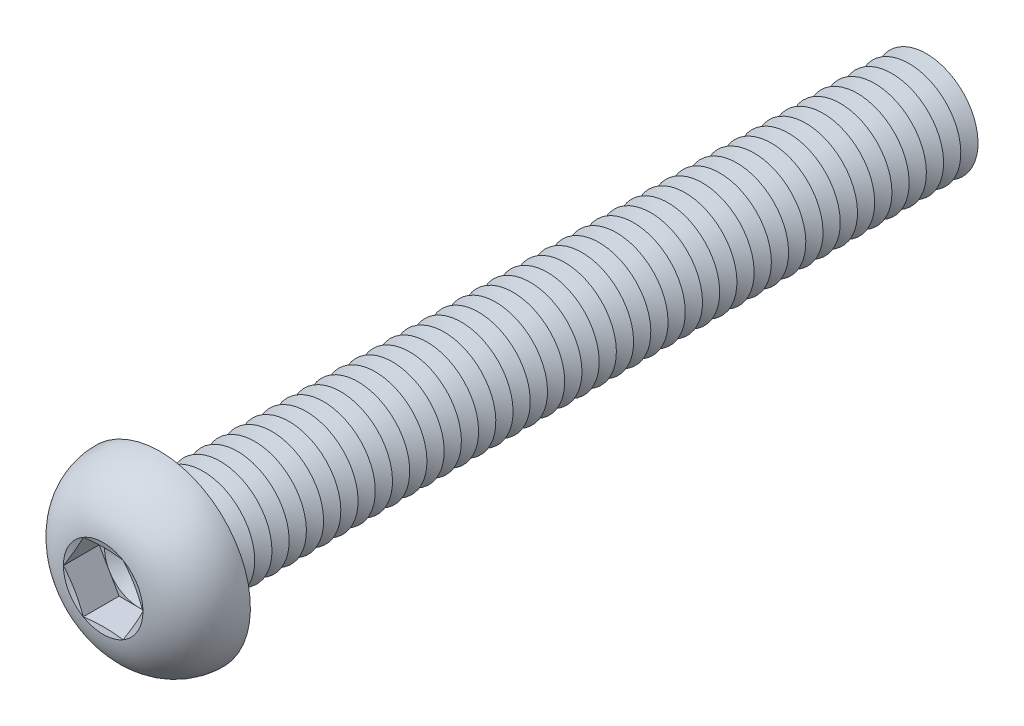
ISO-10303-21;
HEADER;
FILE_DESCRIPTION(('STEP AP214'),'2;1');
FILE_NAME('part.step','',(''),(''),'','','');
FILE_SCHEMA(('AUTOMOTIVE_DESIGN { 1 0 10303 214 1 1 1 1 }'));
ENDSEC;
DATA;
#1=APPLICATION_CONTEXT('core data for automotive mechanical design processes');
#2=APPLICATION_PROTOCOL_DEFINITION('international standard','automotive_design',2000,#1);
#3=PRODUCT_CONTEXT('',#1,'mechanical');
#4=PRODUCT('Part','Part','',(#3));
#5=PRODUCT_RELATED_PRODUCT_CATEGORY('part','',(#4));
#6=PRODUCT_DEFINITION_FORMATION('','',#4);
#7=PRODUCT_DEFINITION_CONTEXT('part definition',#1,'design');
#8=PRODUCT_DEFINITION('design','',#6,#7);
#9=PRODUCT_DEFINITION_SHAPE('','',#8);
#10=(LENGTH_UNIT() NAMED_UNIT(*) SI_UNIT(.MILLI.,.METRE.));
#11=(NAMED_UNIT(*) PLANE_ANGLE_UNIT() SI_UNIT($,.RADIAN.));
#12=(NAMED_UNIT(*) SI_UNIT($,.STERADIAN.) SOLID_ANGLE_UNIT());
#13=UNCERTAINTY_MEASURE_WITH_UNIT(LENGTH_MEASURE(1.E-05),#10,'distance_accuracy_value','');
#14=(GEOMETRIC_REPRESENTATION_CONTEXT(3) GLOBAL_UNCERTAINTY_ASSIGNED_CONTEXT((#13)) GLOBAL_UNIT_ASSIGNED_CONTEXT((#10,
#11,#12)) REPRESENTATION_CONTEXT('',''));
#15=CARTESIAN_POINT('',(0.,0.,0.));
#16=DIRECTION('',(0.,0.,1.));
#17=DIRECTION('',(1.,0.,0.));
#18=AXIS2_PLACEMENT_3D('',#15,#16,#17);
#19=CARTESIAN_POINT('',(0.,0.,1.22));
#20=DIRECTION('',(0.,0.,1.));
#21=DIRECTION('',(1.,0.,0.));
#22=AXIS2_PLACEMENT_3D('',#19,#20,#21);
#23=PLANE('',#22);
#24=CARTESIAN_POINT('',(0.,0.,1.22));
#25=DIRECTION('',(0.,0.,1.));
#26=DIRECTION('',(1.,0.,0.));
#27=AXIS2_PLACEMENT_3D('',#24,#25,#26);
#28=CIRCLE('',#27,1.99999906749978);
#29=CARTESIAN_POINT('',(1.73205,0.999999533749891,1.22));
#30=VERTEX_POINT('',#29);
#31=CARTESIAN_POINT('',(0.,1.99999906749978,1.22));
#32=VERTEX_POINT('',#31);
#33=EDGE_CURVE('E118',#30,#32,#28,.T.);
#34=ORIENTED_EDGE('',*,*,#33,.F.);
#35=DIRECTION('',(-0.5,0.866025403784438,0.));
#36=VECTOR('',#35,1.);
#37=CARTESIAN_POINT('',(2.3094,0.,1.22));
#38=LINE('',#37,#36);
#39=CARTESIAN_POINT('',(1.1547,1.99999906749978,1.22));
#40=VERTEX_POINT('',#39);
#41=EDGE_CURVE('E125',#30,#40,#38,.T.);
#42=ORIENTED_EDGE('',*,*,#41,.T.);
#43=DIRECTION('',(-1.,0.,0.));
#44=VECTOR('',#43,1.);
#45=CARTESIAN_POINT('',(1.1547,1.99999906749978,1.22));
#46=LINE('',#45,#44);
#47=EDGE_CURVE('E136',#40,#32,#46,.T.);
#48=ORIENTED_EDGE('',*,*,#47,.T.);
#49=EDGE_LOOP('',(#34,#42,#48));
#50=FACE_BOUND('',#49,.T.);
#51=ADVANCED_FACE('F39',(#50),#23,.T.);
#52=CARTESIAN_POINT('',(0.,0.,1.22));
#53=DIRECTION('',(0.,0.,1.));
#54=DIRECTION('',(1.,0.,0.));
#55=AXIS2_PLACEMENT_3D('',#52,#53,#54);
#56=CIRCLE('',#55,1.99999906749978);
#57=CARTESIAN_POINT('',(-1.73205,0.999999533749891,1.22));
#58=VERTEX_POINT('',#57);
#59=EDGE_CURVE('E11',#32,#58,#56,.T.);
#60=ORIENTED_EDGE('',*,*,#59,.F.);
#61=CARTESIAN_POINT('',(-1.1547,1.99999906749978,1.22));
#62=VERTEX_POINT('',#61);
#63=EDGE_CURVE('E131',#32,#62,#46,.T.);
#64=ORIENTED_EDGE('',*,*,#63,.T.);
#65=DIRECTION('',(-0.5,-0.866025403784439,0.));
#66=VECTOR('',#65,1.);
#67=CARTESIAN_POINT('',(-1.1547,1.99999906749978,1.22));
#68=LINE('',#67,#66);
#69=EDGE_CURVE('E134',#62,#58,#68,.T.);
#70=ORIENTED_EDGE('',*,*,#69,.T.);
#71=EDGE_LOOP('',(#60,#64,#70));
#72=FACE_BOUND('',#71,.T.);
#73=ADVANCED_FACE('F130',(#72),#23,.T.);
#74=CARTESIAN_POINT('',(-1.73205,-0.999999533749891,1.22));
#75=VERTEX_POINT('',#74);
#76=EDGE_CURVE('E49',#58,#75,#56,.T.);
#77=ORIENTED_EDGE('',*,*,#76,.F.);
#78=CARTESIAN_POINT('',(-2.3094,0.,1.22));
#79=VERTEX_POINT('',#78);
#80=EDGE_CURVE('E143',#58,#79,#68,.T.);
#81=ORIENTED_EDGE('',*,*,#80,.T.);
#82=DIRECTION('',(0.5,-0.866025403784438,0.));
#83=VECTOR('',#82,1.);
#84=CARTESIAN_POINT('',(-2.3094,0.,1.22));
#85=LINE('',#84,#83);
#86=EDGE_CURVE('E152',#79,#75,#85,.T.);
#87=ORIENTED_EDGE('',*,*,#86,.T.);
#88=EDGE_LOOP('',(#77,#81,#87));
#89=FACE_BOUND('',#88,.T.);
#90=ADVANCED_FACE('F627',(#89),#23,.T.);
#91=CARTESIAN_POINT('',(0.,-1.99999906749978,1.22));
#92=VERTEX_POINT('',#91);
#93=EDGE_CURVE('E612',#75,#92,#56,.T.);
#94=ORIENTED_EDGE('',*,*,#93,.F.);
#95=CARTESIAN_POINT('',(-1.1547,-1.99999906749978,1.22));
#96=VERTEX_POINT('',#95);
#97=EDGE_CURVE('E151',#75,#96,#85,.T.);
#98=ORIENTED_EDGE('',*,*,#97,.T.);
#99=DIRECTION('',(1.,0.,0.));
#100=VECTOR('',#99,1.);
#101=CARTESIAN_POINT('',(-1.1547,-1.99999906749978,1.22));
#102=LINE('',#101,#100);
#103=EDGE_CURVE('E157',#96,#92,#102,.T.);
#104=ORIENTED_EDGE('',*,*,#103,.T.);
#105=EDGE_LOOP('',(#94,#98,#104));
#106=FACE_BOUND('',#105,.T.);
#107=ADVANCED_FACE('F620',(#106),#23,.T.);
#108=CARTESIAN_POINT('',(1.73205,-0.999999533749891,1.22));
#109=VERTEX_POINT('',#108);
#110=EDGE_CURVE('E56',#92,#109,#56,.T.);
#111=ORIENTED_EDGE('',*,*,#110,.F.);
#112=CARTESIAN_POINT('',(1.1547,-1.99999906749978,1.22));
#113=VERTEX_POINT('',#112);
#114=EDGE_CURVE('E156',#92,#113,#102,.T.);
#115=ORIENTED_EDGE('',*,*,#114,.T.);
#116=DIRECTION('',(0.5,0.866025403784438,0.));
#117=VECTOR('',#116,1.);
#118=CARTESIAN_POINT('',(1.1547,-1.99999906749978,1.22));
#119=LINE('',#118,#117);
#120=EDGE_CURVE('E162',#113,#109,#119,.T.);
#121=ORIENTED_EDGE('',*,*,#120,.T.);
#122=EDGE_LOOP('',(#111,#115,#121));
#123=FACE_BOUND('',#122,.T.);
#124=ADVANCED_FACE('F696',(#123),#23,.T.);
#125=CARTESIAN_POINT('',(0.,0.,3.3));
#126=DIRECTION('',(0.,0.,1.));
#127=DIRECTION('',(0.,-1.,0.));
#128=AXIS2_PLACEMENT_3D('',#125,#126,#127);
#129=CONICAL_SURFACE('',#128,2.3094,1.30899693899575);
#130=CARTESIAN_POINT('',(2.30951547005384,-0.000200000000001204,3.30003094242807));
#131=CARTESIAN_POINT('',(2.26155412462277,0.082871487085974,3.2871729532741));
#132=CARTESIAN_POINT('',(2.21350580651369,0.166093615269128,3.27549992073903));
#133=CARTESIAN_POINT('',(2.11723944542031,0.332831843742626,3.2549913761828));
#134=CARTESIAN_POINT('',(2.06902134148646,0.416348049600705,3.24615701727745));
#135=CARTESIAN_POINT('',(1.97270782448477,0.583167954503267,3.23184167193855));
#136=CARTESIAN_POINT('',(1.92461306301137,0.666470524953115,3.22634360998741));
#137=CARTESIAN_POINT('',(1.82836219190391,0.833181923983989,3.21897125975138));
#138=CARTESIAN_POINT('',(1.78020609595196,0.916590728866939,3.21709626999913));
#139=CARTESIAN_POINT('',(1.68389390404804,1.08340833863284,3.21709626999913));
#140=CARTESIAN_POINT('',(1.63573780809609,1.16681714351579,3.21897125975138));
#141=CARTESIAN_POINT('',(1.53948693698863,1.33352854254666,3.22634360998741));
#142=CARTESIAN_POINT('',(1.49139217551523,1.41683111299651,3.23184167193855));
#143=CARTESIAN_POINT('',(1.39507865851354,1.58365101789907,3.24615701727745));
#144=CARTESIAN_POINT('',(1.34686055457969,1.66716722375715,3.2549913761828));
#145=CARTESIAN_POINT('',(1.25059419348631,1.83390545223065,3.27549992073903));
#146=CARTESIAN_POINT('',(1.20254587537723,1.9171275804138,3.2871729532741));
#147=CARTESIAN_POINT('',(1.15458452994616,2.00019906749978,3.30003094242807));
#148=B_SPLINE_CURVE_WITH_KNOTS('',3,(#130,#131,#132,#133,#134,#135,#136,#137,#138,#139,#140,
#141,#142,#143,#144,#145,#146,#147),.UNSPECIFIED.,.F.,.F.,(4,2,2,2,2,2,2,2,4),(0.,
0.290357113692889,0.580832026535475,0.869807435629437,1.15872689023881,1.44764634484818,
1.73662175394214,2.02709666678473,2.31745378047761),.UNSPECIFIED.);
#149=CARTESIAN_POINT('',(2.3094,0.,3.3));
#150=VERTEX_POINT('',#149);
#151=CARTESIAN_POINT('',(1.15469999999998,1.99999906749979,3.3));
#152=VERTEX_POINT('',#151);
#153=EDGE_CURVE('E221',#150,#152,#148,.T.);
#154=ORIENTED_EDGE('',*,*,#153,.F.);
#155=CARTESIAN_POINT('',(0.,0.,3.3));
#156=DIRECTION('',(0.,0.,-1.));
#157=DIRECTION('',(0.,1.,0.));
#158=AXIS2_PLACEMENT_3D('',#155,#156,#157);
#159=CIRCLE('',#158,2.3094);
#160=EDGE_CURVE('E596',#152,#150,#159,.T.);
#161=ORIENTED_EDGE('',*,*,#160,.F.);
#162=EDGE_LOOP('',(#154,#161));
#163=FACE_BOUND('',#162,.T.);
#164=ADVANCED_FACE('F700',(#163),#129,.F.);
#165=CARTESIAN_POINT('',(1.15458452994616,-2.00019906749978,3.30003094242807));
#166=CARTESIAN_POINT('',(1.20254587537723,-1.91712758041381,3.2871729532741));
#167=CARTESIAN_POINT('',(1.25059419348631,-1.83390545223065,3.27549992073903));
#168=CARTESIAN_POINT('',(1.34686055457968,-1.66716722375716,3.2549913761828));
#169=CARTESIAN_POINT('',(1.39507865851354,-1.58365101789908,3.24615701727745));
#170=CARTESIAN_POINT('',(1.49139217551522,-1.41683111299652,3.23184167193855));
#171=CARTESIAN_POINT('',(1.53948693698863,-1.33352854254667,3.22634360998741));
#172=CARTESIAN_POINT('',(1.63573780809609,-1.16681714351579,3.21897125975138));
#173=CARTESIAN_POINT('',(1.68389390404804,-1.08340833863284,3.21709626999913));
#174=CARTESIAN_POINT('',(1.78020609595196,-0.916590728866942,3.21709626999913));
#175=CARTESIAN_POINT('',(1.82836219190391,-0.833181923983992,3.21897125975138));
#176=CARTESIAN_POINT('',(1.92461306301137,-0.666470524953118,3.22634360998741));
#177=CARTESIAN_POINT('',(1.97270782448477,-0.58316795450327,3.23184167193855));
#178=CARTESIAN_POINT('',(2.06902134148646,-0.416348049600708,3.24615701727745));
#179=CARTESIAN_POINT('',(2.11723944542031,-0.332831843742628,3.2549913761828));
#180=CARTESIAN_POINT('',(2.21350580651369,-0.16609361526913,3.27549992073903));
#181=CARTESIAN_POINT('',(2.26155412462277,-0.0828714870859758,3.2871729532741));
#182=CARTESIAN_POINT('',(2.30951547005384,0.000199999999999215,3.30003094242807));
#183=B_SPLINE_CURVE_WITH_KNOTS('',3,(#165,#166,#167,#168,#169,#170,#171,#172,#173,#174,#175,
#176,#177,#178,#179,#180,#181,#182),.UNSPECIFIED.,.F.,.F.,(4,2,2,2,2,2,2,2,4),(0.,
0.290357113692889,0.580832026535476,0.869807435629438,1.15872689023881,1.44764634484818,
1.73662175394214,2.02709666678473,2.31745378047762),.UNSPECIFIED.);
#184=CARTESIAN_POINT('',(1.1547,-1.99999906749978,3.3));
#185=VERTEX_POINT('',#184);
#186=EDGE_CURVE('E230',#185,#150,#183,.T.);
#187=ORIENTED_EDGE('',*,*,#186,.F.);
#188=EDGE_CURVE('E601',#150,#185,#159,.T.);
#189=ORIENTED_EDGE('',*,*,#188,.F.);
#190=EDGE_LOOP('',(#187,#189));
#191=FACE_BOUND('',#190,.T.);
#192=ADVANCED_FACE('F662',(#191),#129,.F.);
#193=CARTESIAN_POINT('',(-3.4849337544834,-1.99999906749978,3.75783251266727));
#194=CARTESIAN_POINT('',(-3.40057136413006,-1.99999906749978,3.73822859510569));
#195=CARTESIAN_POINT('',(-3.31617090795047,-1.99999906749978,3.71878852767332));
#196=CARTESIAN_POINT('',(-3.14727791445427,-1.99999906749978,3.68030638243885));
#197=CARTESIAN_POINT('',(-3.06278537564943,-1.99999906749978,3.66126431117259));
#198=CARTESIAN_POINT('',(-2.80911712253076,-1.99999906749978,3.60483420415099));
#199=CARTESIAN_POINT('',(-2.63978343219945,-1.99999906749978,3.5681499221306));
#200=CARTESIAN_POINT('',(-2.29895421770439,-1.99999906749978,3.49717072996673));
#201=CARTESIAN_POINT('',(-2.12745330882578,-1.99999906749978,3.4629014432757));
#202=CARTESIAN_POINT('',(-1.78364663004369,-1.99999906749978,3.39849485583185));
#203=CARTESIAN_POINT('',(-1.61134079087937,-1.99999906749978,3.36835791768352));
#204=CARTESIAN_POINT('',(-1.27040784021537,-1.99999906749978,3.31501553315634));
#205=CARTESIAN_POINT('',(-1.10180724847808,-1.99999906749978,3.291644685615));
#206=CARTESIAN_POINT('',(-0.763641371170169,-1.99999906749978,3.2533727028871));
#207=CARTESIAN_POINT('',(-0.594076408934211,-1.99999906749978,3.23846888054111));
#208=CARTESIAN_POINT('',(-0.339649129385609,-1.99999906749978,3.22431372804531));
#209=CARTESIAN_POINT('',(-0.255009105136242,-1.99999906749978,3.22096057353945));
#210=CARTESIAN_POINT('',(-0.0856618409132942,-1.99999906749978,3.21711210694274));
#211=CARTESIAN_POINT('',(-0.000954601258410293,-1.99999906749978,3.2166167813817));
#212=CARTESIAN_POINT('',(0.16843098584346,-1.99999906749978,3.21851478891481));
#213=CARTESIAN_POINT('',(0.253109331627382,-1.99999906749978,3.2209082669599));
#214=CARTESIAN_POINT('',(0.422344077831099,-1.99999906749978,3.22845792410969));
#215=CARTESIAN_POINT('',(0.506900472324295,-1.99999906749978,3.23361423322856));
#216=CARTESIAN_POINT('',(0.712240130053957,-1.99999906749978,3.24921577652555));
#217=CARTESIAN_POINT('',(0.832922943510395,-1.99999906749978,3.26098285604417));
#218=CARTESIAN_POINT('',(1.07378161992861,-1.99999906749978,3.28874908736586));
#219=CARTESIAN_POINT('',(1.1939575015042,-1.99999906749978,3.30474808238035));
#220=CARTESIAN_POINT('',(1.43419655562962,-1.99999906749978,3.34009172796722));
#221=CARTESIAN_POINT('',(1.55425817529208,-1.99999906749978,3.35944677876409));
#222=CARTESIAN_POINT('',(1.79394991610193,-1.99999906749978,3.40067076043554));
#223=CARTESIAN_POINT('',(1.91358001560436,-1.99999906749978,3.42253981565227));
#224=CARTESIAN_POINT('',(2.15493405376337,-1.99999906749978,3.46864194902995));
#225=CARTESIAN_POINT('',(2.27665041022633,-1.99999906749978,3.49291441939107));
#226=CARTESIAN_POINT('',(2.51977680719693,-1.99999906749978,3.54294628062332));
#227=CARTESIAN_POINT('',(2.64118684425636,-1.99999906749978,3.56870568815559));
#228=CARTESIAN_POINT('',(2.88310060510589,-1.99999906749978,3.62120891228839));
#229=CARTESIAN_POINT('',(3.00360566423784,-1.99999906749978,3.6479466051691));
#230=CARTESIAN_POINT('',(3.24441021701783,-1.99999906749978,3.7022947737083));
#231=CARTESIAN_POINT('',(3.36470972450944,-1.99999906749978,3.72990518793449));
#232=CARTESIAN_POINT('',(3.4849337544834,-1.99999906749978,3.75783251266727));
#233=B_SPLINE_CURVE_WITH_KNOTS('',3,(#193,#194,#195,#196,#197,#198,#199,#200,#201,#202,#203,
#204,#205,#206,#207,#208,#209,#210,#211,#212,#213,#214,#215,#216,#217,#218,#219,#220,#221,#222,
#223,#224,#225,#226,#227,#228,#229,#230,#231,#232),.UNSPECIFIED.,.F.,.F.,(4,2,2,2,2,2,2,2,2,2,2,
2,2,2,2,2,2,2,2,4),(0.,0.259830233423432,0.519664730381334,1.03943435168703,1.56407662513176,
2.08876490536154,2.59926476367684,3.10960251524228,3.36367930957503,3.61775490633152,
3.87184325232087,4.1259435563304,4.48960924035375,4.85326145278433,5.21806142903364,
5.58287945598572,5.95520617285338,6.32753706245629,6.69784064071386,7.06811821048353),.UNSPECIFIED.);
#234=CARTESIAN_POINT('',(-1.1547,-1.99999906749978,3.3));
#235=VERTEX_POINT('',#234);
#236=EDGE_CURVE('E641',#235,#185,#233,.T.);
#237=ORIENTED_EDGE('',*,*,#236,.F.);
#238=EDGE_CURVE('E654',#185,#235,#159,.T.);
#239=ORIENTED_EDGE('',*,*,#238,.F.);
#240=EDGE_LOOP('',(#237,#239));
#241=FACE_BOUND('',#240,.T.);
#242=ADVANCED_FACE('F668',(#241),#129,.F.);
#243=CARTESIAN_POINT('',(-2.30951547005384,0.000199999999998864,3.30003094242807));
#244=CARTESIAN_POINT('',(-2.26155412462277,-0.0828714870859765,3.2871729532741));
#245=CARTESIAN_POINT('',(-2.21350580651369,-0.166093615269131,3.27549992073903));
#246=CARTESIAN_POINT('',(-2.11723944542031,-0.332831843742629,3.2549913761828));
#247=CARTESIAN_POINT('',(-2.06902134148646,-0.416348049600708,3.24615701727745));
#248=CARTESIAN_POINT('',(-1.97270782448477,-0.58316795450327,3.23184167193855));
#249=CARTESIAN_POINT('',(-1.92461306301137,-0.666470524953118,3.22634360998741));
#250=CARTESIAN_POINT('',(-1.82836219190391,-0.833181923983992,3.21897125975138));
#251=CARTESIAN_POINT('',(-1.78020609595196,-0.916590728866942,3.21709626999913));
#252=CARTESIAN_POINT('',(-1.68389390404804,-1.08340833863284,3.21709626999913));
#253=CARTESIAN_POINT('',(-1.63573780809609,-1.16681714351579,3.21897125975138));
#254=CARTESIAN_POINT('',(-1.53948693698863,-1.33352854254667,3.22634360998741));
#255=CARTESIAN_POINT('',(-1.49139217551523,-1.41683111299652,3.23184167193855));
#256=CARTESIAN_POINT('',(-1.39507865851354,-1.58365101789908,3.24615701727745));
#257=CARTESIAN_POINT('',(-1.34686055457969,-1.66716722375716,3.2549913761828));
#258=CARTESIAN_POINT('',(-1.25059419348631,-1.83390545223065,3.27549992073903));
#259=CARTESIAN_POINT('',(-1.20254587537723,-1.91712758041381,3.2871729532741));
#260=CARTESIAN_POINT('',(-1.15458452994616,-2.00019906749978,3.30003094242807));
#261=B_SPLINE_CURVE_WITH_KNOTS('',3,(#243,#244,#245,#246,#247,#248,#249,#250,#251,#252,#253,
#254,#255,#256,#257,#258,#259,#260),.UNSPECIFIED.,.F.,.F.,(4,2,2,2,2,2,2,2,4),(0.,
0.290357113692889,0.580832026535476,0.869807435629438,1.15872689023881,1.44764634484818,
1.73662175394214,2.02709666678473,2.31745378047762),.UNSPECIFIED.);
#262=CARTESIAN_POINT('',(-2.3094,0.,3.3));
#263=VERTEX_POINT('',#262);
#264=EDGE_CURVE('E632',#263,#235,#261,.T.);
#265=ORIENTED_EDGE('',*,*,#264,.F.);
#266=EDGE_CURVE('E638',#235,#263,#159,.T.);
#267=ORIENTED_EDGE('',*,*,#266,.F.);
#268=EDGE_LOOP('',(#265,#267));
#269=FACE_BOUND('',#268,.T.);
#270=ADVANCED_FACE('F636',(#269),#129,.F.);
#271=CARTESIAN_POINT('',(-1.15458452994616,2.00019906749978,3.30003094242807));
#272=CARTESIAN_POINT('',(-1.20254587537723,1.9171275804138,3.2871729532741));
#273=CARTESIAN_POINT('',(-1.25059419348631,1.83390545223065,3.27549992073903));
#274=CARTESIAN_POINT('',(-1.34686055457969,1.66716722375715,3.2549913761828));
#275=CARTESIAN_POINT('',(-1.39507865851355,1.58365101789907,3.24615701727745));
#276=CARTESIAN_POINT('',(-1.49139217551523,1.41683111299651,3.23184167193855));
#277=CARTESIAN_POINT('',(-1.53948693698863,1.33352854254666,3.22634360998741));
#278=CARTESIAN_POINT('',(-1.63573780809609,1.16681714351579,3.21897125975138));
#279=CARTESIAN_POINT('',(-1.68389390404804,1.08340833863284,3.21709626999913));
#280=CARTESIAN_POINT('',(-1.78020609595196,0.916590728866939,3.21709626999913));
#281=CARTESIAN_POINT('',(-1.82836219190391,0.833181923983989,3.21897125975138));
#282=CARTESIAN_POINT('',(-1.92461306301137,0.666470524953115,3.22634360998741));
#283=CARTESIAN_POINT('',(-1.97270782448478,0.583167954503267,3.23184167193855));
#284=CARTESIAN_POINT('',(-2.06902134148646,0.416348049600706,3.24615701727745));
#285=CARTESIAN_POINT('',(-2.11723944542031,0.332831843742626,3.2549913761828));
#286=CARTESIAN_POINT('',(-2.21350580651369,0.166093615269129,3.27549992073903));
#287=CARTESIAN_POINT('',(-2.26155412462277,0.0828714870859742,3.2871729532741));
#288=CARTESIAN_POINT('',(-2.30951547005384,-0.000200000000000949,3.30003094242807));
#289=B_SPLINE_CURVE_WITH_KNOTS('',3,(#271,#272,#273,#274,#275,#276,#277,#278,#279,#280,#281,
#282,#283,#284,#285,#286,#287,#288),.UNSPECIFIED.,.F.,.F.,(4,2,2,2,2,2,2,2,4),(0.,
0.290357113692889,0.580832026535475,0.869807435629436,1.15872689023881,1.44764634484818,
1.73662175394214,2.02709666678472,2.31745378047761),.UNSPECIFIED.);
#290=CARTESIAN_POINT('',(-1.1547,1.99999906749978,3.3));
#291=VERTEX_POINT('',#290);
#292=EDGE_CURVE('E195',#291,#263,#289,.T.);
#293=ORIENTED_EDGE('',*,*,#292,.F.);
#294=EDGE_CURVE('E644',#263,#291,#159,.T.);
#295=ORIENTED_EDGE('',*,*,#294,.F.);
#296=EDGE_LOOP('',(#293,#295));
#297=FACE_BOUND('',#296,.T.);
#298=ADVANCED_FACE('F645',(#297),#129,.F.);
#299=CARTESIAN_POINT('',(0.,0.,-41.5));
#300=DIRECTION('',(0.,0.,1.));
#301=DIRECTION('',(0.,-1.,0.));
#302=AXIS2_PLACEMENT_3D('',#299,#300,#301);
#303=CONICAL_SURFACE('',#302,2.99999999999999,1.0471975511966);
#304=CARTESIAN_POINT('',(0.,0.,-42.));
#305=DIRECTION('',(0.,0.,1.));
#306=DIRECTION('',(0.,-1.,0.));
#307=AXIS2_PLACEMENT_3D('',#304,#305,#306);
#308=CIRCLE('',#307,2.13397459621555);
#309=CARTESIAN_POINT('',(0.,-2.13397459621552,-42.));
#310=VERTEX_POINT('',#309);
#311=EDGE_CURVE('E567',#310,#310,#308,.T.);
#312=ORIENTED_EDGE('',*,*,#311,.T.);
#313=EDGE_LOOP('',(#312));
#314=FACE_BOUND('',#313,.T.);
#315=CARTESIAN_POINT('',(0.,0.,-41.5));
#316=DIRECTION('',(0.,0.,1.));
#317=DIRECTION('',(0.,-1.,0.));
#318=AXIS2_PLACEMENT_3D('',#315,#316,#317);
#319=CIRCLE('',#318,2.99999999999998);
#320=CARTESIAN_POINT('',(0.,-2.99999999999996,-41.5));
#321=VERTEX_POINT('',#320);
#322=EDGE_CURVE('E563',#321,#321,#319,.T.);
#323=ORIENTED_EDGE('',*,*,#322,.F.);
#324=EDGE_LOOP('',(#323));
#325=FACE_BOUND('',#324,.T.);
#326=ADVANCED_FACE('F728',(#314,#325),#303,.T.);
#327=CARTESIAN_POINT('',(0.,0.,-42.));
#328=DIRECTION('',(0.,0.,-1.));
#329=DIRECTION('',(0.,1.,0.));
#330=AXIS2_PLACEMENT_3D('',#327,#328,#329);
#331=CONICAL_SURFACE('',#330,2.13397459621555,1.0471975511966);
#332=CARTESIAN_POINT('',(0.,0.,-42.5));
#333=DIRECTION('',(0.,0.,1.));
#334=DIRECTION('',(0.,-1.,0.));
#335=AXIS2_PLACEMENT_3D('',#332,#333,#334);
#336=CIRCLE('',#335,2.99999999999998);
#337=CARTESIAN_POINT('',(0.,-2.99999999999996,-42.5));
#338=VERTEX_POINT('',#337);
#339=EDGE_CURVE('E571',#338,#338,#336,.T.);
#340=ORIENTED_EDGE('',*,*,#339,.T.);
#341=EDGE_LOOP('',(#340));
#342=FACE_BOUND('',#341,.T.);
#343=ORIENTED_EDGE('',*,*,#311,.F.);
#344=EDGE_LOOP('',(#343));
#345=FACE_BOUND('',#344,.T.);
#346=ADVANCED_FACE('F733',(#342,#345),#331,.T.);
#347=CARTESIAN_POINT('',(0.,3.,-45.));
#348=DIRECTION('',(0.,0.,-1.));
#349=DIRECTION('',(0.,1.,0.));
#350=AXIS2_PLACEMENT_3D('',#347,#348,#349);
#351=PLANE('',#350);
#352=CARTESIAN_POINT('',(0.,0.,-45.));
#353=DIRECTION('',(0.,0.,1.));
#354=DIRECTION('',(0.,-1.,0.));
#355=AXIS2_PLACEMENT_3D('',#352,#353,#354);
#356=CIRCLE('',#355,2.13397459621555);
#357=CARTESIAN_POINT('',(0.,-2.13397459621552,-45.));
#358=VERTEX_POINT('',#357);
#359=EDGE_CURVE('E591',#358,#358,#356,.T.);
#360=ORIENTED_EDGE('',*,*,#359,.F.);
#361=EDGE_LOOP('',(#360));
#362=FACE_BOUND('',#361,.T.);
#363=ADVANCED_FACE('F900',(#362),#351,.T.);
#364=CARTESIAN_POINT('',(0.,0.,-44.5));
#365=DIRECTION('',(0.,0.,1.));
#366=DIRECTION('',(0.,-1.,0.));
#367=AXIS2_PLACEMENT_3D('',#364,#365,#366);
#368=CONICAL_SURFACE('',#367,2.99999999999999,1.0471975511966);
#369=ORIENTED_EDGE('',*,*,#359,.T.);
#370=EDGE_LOOP('',(#369));
#371=FACE_BOUND('',#370,.T.);
#372=CARTESIAN_POINT('',(0.,0.,-44.5));
#373=DIRECTION('',(0.,0.,1.));
#374=DIRECTION('',(0.,-1.,0.));
#375=AXIS2_PLACEMENT_3D('',#372,#373,#374);
#376=CIRCLE('',#375,2.99999999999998);
#377=CARTESIAN_POINT('',(0.,-2.99999999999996,-44.5));
#378=VERTEX_POINT('',#377);
#379=EDGE_CURVE('E587',#378,#378,#376,.T.);
#380=ORIENTED_EDGE('',*,*,#379,.F.);
#381=EDGE_LOOP('',(#380));
#382=FACE_BOUND('',#381,.T.);
#383=ADVANCED_FACE('F893',(#371,#382),#368,.T.);
#384=CARTESIAN_POINT('',(0.,0.,-44.));
#385=DIRECTION('',(0.,0.,-1.));
#386=DIRECTION('',(0.,1.,0.));
#387=AXIS2_PLACEMENT_3D('',#384,#385,#386);
#388=CONICAL_SURFACE('',#387,2.13397459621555,1.0471975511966);
#389=ORIENTED_EDGE('',*,*,#379,.T.);
#390=EDGE_LOOP('',(#389));
#391=FACE_BOUND('',#390,.T.);
#392=CARTESIAN_POINT('',(0.,0.,-44.));
#393=DIRECTION('',(0.,0.,1.));
#394=DIRECTION('',(0.,-1.,0.));
#395=AXIS2_PLACEMENT_3D('',#392,#393,#394);
#396=CIRCLE('',#395,2.13397459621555);
#397=CARTESIAN_POINT('',(0.,-2.13397459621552,-44.));
#398=VERTEX_POINT('',#397);
#399=EDGE_CURVE('E583',#398,#398,#396,.T.);
#400=ORIENTED_EDGE('',*,*,#399,.F.);
#401=EDGE_LOOP('',(#400));
#402=FACE_BOUND('',#401,.T.);
#403=ADVANCED_FACE('F899',(#391,#402),#388,.T.);
#404=CARTESIAN_POINT('',(0.,0.,-43.5));
#405=DIRECTION('',(0.,0.,1.));
#406=DIRECTION('',(0.,-1.,0.));
#407=AXIS2_PLACEMENT_3D('',#404,#405,#406);
#408=CONICAL_SURFACE('',#407,2.99999999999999,1.0471975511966);
#409=ORIENTED_EDGE('',*,*,#399,.T.);
#410=EDGE_LOOP('',(#409));
#411=FACE_BOUND('',#410,.T.);
#412=CARTESIAN_POINT('',(0.,0.,-43.5));
#413=DIRECTION('',(0.,0.,1.));
#414=DIRECTION('',(0.,-1.,0.));
#415=AXIS2_PLACEMENT_3D('',#412,#413,#414);
#416=CIRCLE('',#415,2.99999999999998);
#417=CARTESIAN_POINT('',(0.,-2.99999999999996,-43.5));
#418=VERTEX_POINT('',#417);
#419=EDGE_CURVE('E579',#418,#418,#416,.T.);
#420=ORIENTED_EDGE('',*,*,#419,.F.);
#421=EDGE_LOOP('',(#420));
#422=FACE_BOUND('',#421,.T.);
#423=ADVANCED_FACE('F931',(#411,#422),#408,.T.);
#424=CARTESIAN_POINT('',(0.,0.,-43.));
#425=DIRECTION('',(0.,0.,-1.));
#426=DIRECTION('',(0.,1.,0.));
#427=AXIS2_PLACEMENT_3D('',#424,#425,#426);
#428=CONICAL_SURFACE('',#427,2.13397459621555,1.0471975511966);
#429=ORIENTED_EDGE('',*,*,#419,.T.);
#430=EDGE_LOOP('',(#429));
#431=FACE_BOUND('',#430,.T.);
#432=CARTESIAN_POINT('',(0.,0.,-43.));
#433=DIRECTION('',(0.,0.,1.));
#434=DIRECTION('',(0.,-1.,0.));
#435=AXIS2_PLACEMENT_3D('',#432,#433,#434);
#436=CIRCLE('',#435,2.13397459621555);
#437=CARTESIAN_POINT('',(0.,-2.13397459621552,-43.));
#438=VERTEX_POINT('',#437);
#439=EDGE_CURVE('E575',#438,#438,#436,.T.);
#440=ORIENTED_EDGE('',*,*,#439,.F.);
#441=EDGE_LOOP('',(#440));
#442=FACE_BOUND('',#441,.T.);
#443=ADVANCED_FACE('F941',(#431,#442),#428,.T.);
#444=CARTESIAN_POINT('',(0.,0.,-42.5));
#445=DIRECTION('',(0.,0.,1.));
#446=DIRECTION('',(0.,-1.,0.));
#447=AXIS2_PLACEMENT_3D('',#444,#445,#446);
#448=CONICAL_SURFACE('',#447,2.99999999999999,1.0471975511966);
#449=ORIENTED_EDGE('',*,*,#439,.T.);
#450=EDGE_LOOP('',(#449));
#451=FACE_BOUND('',#450,.T.);
#452=ORIENTED_EDGE('',*,*,#339,.F.);
#453=EDGE_LOOP('',(#452));
#454=FACE_BOUND('',#453,.T.);
#455=ADVANCED_FACE('F951',(#451,#454),#448,.T.);
#456=CARTESIAN_POINT('',(0.,0.,-40.5));
#457=DIRECTION('',(0.,0.,1.));
#458=DIRECTION('',(0.,-1.,0.));
#459=AXIS2_PLACEMENT_3D('',#456,#457,#458);
#460=CONICAL_SURFACE('',#459,2.99999999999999,1.0471975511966);
#461=CARTESIAN_POINT('',(0.,0.,-41.));
#462=DIRECTION('',(0.,0.,1.));
#463=DIRECTION('',(0.,-1.,0.));
#464=AXIS2_PLACEMENT_3D('',#461,#462,#463);
#465=CIRCLE('',#464,2.13397459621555);
#466=CARTESIAN_POINT('',(0.,-2.13397459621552,-41.));
#467=VERTEX_POINT('',#466);
#468=EDGE_CURVE('E559',#467,#467,#465,.T.);
#469=ORIENTED_EDGE('',*,*,#468,.T.);
#470=EDGE_LOOP('',(#469));
#471=FACE_BOUND('',#470,.T.);
#472=CARTESIAN_POINT('',(0.,0.,-40.5));
#473=DIRECTION('',(0.,0.,1.));
#474=DIRECTION('',(0.,-1.,0.));
#475=AXIS2_PLACEMENT_3D('',#472,#473,#474);
#476=CIRCLE('',#475,2.99999999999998);
#477=CARTESIAN_POINT('',(0.,-2.99999999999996,-40.5));
#478=VERTEX_POINT('',#477);
#479=EDGE_CURVE('E555',#478,#478,#476,.T.);
#480=ORIENTED_EDGE('',*,*,#479,.F.);
#481=EDGE_LOOP('',(#480));
#482=FACE_BOUND('',#481,.T.);
#483=ADVANCED_FACE('F961',(#471,#482),#460,.T.);
#484=CARTESIAN_POINT('',(0.,0.,-41.));
#485=DIRECTION('',(0.,0.,-1.));
#486=DIRECTION('',(0.,1.,0.));
#487=AXIS2_PLACEMENT_3D('',#484,#485,#486);
#488=CONICAL_SURFACE('',#487,2.13397459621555,1.0471975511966);
#489=ORIENTED_EDGE('',*,*,#322,.T.);
#490=EDGE_LOOP('',(#489));
#491=FACE_BOUND('',#490,.T.);
#492=ORIENTED_EDGE('',*,*,#468,.F.);
#493=EDGE_LOOP('',(#492));
#494=FACE_BOUND('',#493,.T.);
#495=ADVANCED_FACE('F971',(#491,#494),#488,.T.);
#496=CARTESIAN_POINT('',(0.,0.,-39.5));
#497=DIRECTION('',(0.,0.,1.));
#498=DIRECTION('',(0.,-1.,0.));
#499=AXIS2_PLACEMENT_3D('',#496,#497,#498);
#500=CONICAL_SURFACE('',#499,2.99999999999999,1.0471975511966);
#501=CARTESIAN_POINT('',(0.,0.,-40.));
#502=DIRECTION('',(0.,0.,1.));
#503=DIRECTION('',(0.,-1.,0.));
#504=AXIS2_PLACEMENT_3D('',#501,#502,#503);
#505=CIRCLE('',#504,2.13397459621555);
#506=CARTESIAN_POINT('',(0.,-2.13397459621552,-40.));
#507=VERTEX_POINT('',#506);
#508=EDGE_CURVE('E551',#507,#507,#505,.T.);
#509=ORIENTED_EDGE('',*,*,#508,.T.);
#510=EDGE_LOOP('',(#509));
#511=FACE_BOUND('',#510,.T.);
#512=CARTESIAN_POINT('',(0.,0.,-39.5));
#513=DIRECTION('',(0.,0.,1.));
#514=DIRECTION('',(0.,-1.,0.));
#515=AXIS2_PLACEMENT_3D('',#512,#513,#514);
#516=CIRCLE('',#515,2.99999999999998);
#517=CARTESIAN_POINT('',(0.,-2.99999999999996,-39.5));
#518=VERTEX_POINT('',#517);
#519=EDGE_CURVE('E547',#518,#518,#516,.T.);
#520=ORIENTED_EDGE('',*,*,#519,.F.);
#521=EDGE_LOOP('',(#520));
#522=FACE_BOUND('',#521,.T.);
#523=ADVANCED_FACE('F981',(#511,#522),#500,.T.);
#524=CARTESIAN_POINT('',(0.,0.,-40.));
#525=DIRECTION('',(0.,0.,-1.));
#526=DIRECTION('',(0.,1.,0.));
#527=AXIS2_PLACEMENT_3D('',#524,#525,#526);
#528=CONICAL_SURFACE('',#527,2.13397459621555,1.0471975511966);
#529=ORIENTED_EDGE('',*,*,#479,.T.);
#530=EDGE_LOOP('',(#529));
#531=FACE_BOUND('',#530,.T.);
#532=ORIENTED_EDGE('',*,*,#508,.F.);
#533=EDGE_LOOP('',(#532));
#534=FACE_BOUND('',#533,.T.);
#535=ADVANCED_FACE('F991',(#531,#534),#528,.T.);
#536=CARTESIAN_POINT('',(0.,0.,-38.5));
#537=DIRECTION('',(0.,0.,1.));
#538=DIRECTION('',(0.,-1.,0.));
#539=AXIS2_PLACEMENT_3D('',#536,#537,#538);
#540=CONICAL_SURFACE('',#539,2.99999999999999,1.0471975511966);
#541=CARTESIAN_POINT('',(0.,0.,-39.));
#542=DIRECTION('',(0.,0.,1.));
#543=DIRECTION('',(0.,-1.,0.));
#544=AXIS2_PLACEMENT_3D('',#541,#542,#543);
#545=CIRCLE('',#544,2.13397459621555);
#546=CARTESIAN_POINT('',(0.,-2.13397459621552,-39.));
#547=VERTEX_POINT('',#546);
#548=EDGE_CURVE('E543',#547,#547,#545,.T.);
#549=ORIENTED_EDGE('',*,*,#548,.T.);
#550=EDGE_LOOP('',(#549));
#551=FACE_BOUND('',#550,.T.);
#552=CARTESIAN_POINT('',(0.,0.,-38.5));
#553=DIRECTION('',(0.,0.,1.));
#554=DIRECTION('',(0.,-1.,0.));
#555=AXIS2_PLACEMENT_3D('',#552,#553,#554);
#556=CIRCLE('',#555,2.99999999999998);
#557=CARTESIAN_POINT('',(0.,-2.99999999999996,-38.5));
#558=VERTEX_POINT('',#557);
#559=EDGE_CURVE('E539',#558,#558,#556,.T.);
#560=ORIENTED_EDGE('',*,*,#559,.F.);
#561=EDGE_LOOP('',(#560));
#562=FACE_BOUND('',#561,.T.);
#563=ADVANCED_FACE('F1001',(#551,#562),#540,.T.);
#564=CARTESIAN_POINT('',(0.,0.,-39.));
#565=DIRECTION('',(0.,0.,-1.));
#566=DIRECTION('',(0.,1.,0.));
#567=AXIS2_PLACEMENT_3D('',#564,#565,#566);
#568=CONICAL_SURFACE('',#567,2.13397459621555,1.0471975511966);
#569=ORIENTED_EDGE('',*,*,#519,.T.);
#570=EDGE_LOOP('',(#569));
#571=FACE_BOUND('',#570,.T.);
#572=ORIENTED_EDGE('',*,*,#548,.F.);
#573=EDGE_LOOP('',(#572));
#574=FACE_BOUND('',#573,.T.);
#575=ADVANCED_FACE('F1011',(#571,#574),#568,.T.);
#576=CARTESIAN_POINT('',(0.,0.,-37.5));
#577=DIRECTION('',(0.,0.,1.));
#578=DIRECTION('',(0.,-1.,0.));
#579=AXIS2_PLACEMENT_3D('',#576,#577,#578);
#580=CONICAL_SURFACE('',#579,2.99999999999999,1.0471975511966);
#581=CARTESIAN_POINT('',(0.,0.,-38.));
#582=DIRECTION('',(0.,0.,1.));
#583=DIRECTION('',(0.,-1.,0.));
#584=AXIS2_PLACEMENT_3D('',#581,#582,#583);
#585=CIRCLE('',#584,2.13397459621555);
#586=CARTESIAN_POINT('',(0.,-2.13397459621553,-38.));
#587=VERTEX_POINT('',#586);
#588=EDGE_CURVE('E535',#587,#587,#585,.T.);
#589=ORIENTED_EDGE('',*,*,#588,.T.);
#590=EDGE_LOOP('',(#589));
#591=FACE_BOUND('',#590,.T.);
#592=CARTESIAN_POINT('',(0.,0.,-37.5));
#593=DIRECTION('',(0.,0.,1.));
#594=DIRECTION('',(0.,-1.,0.));
#595=AXIS2_PLACEMENT_3D('',#592,#593,#594);
#596=CIRCLE('',#595,2.99999999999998);
#597=CARTESIAN_POINT('',(0.,-2.99999999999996,-37.5));
#598=VERTEX_POINT('',#597);
#599=EDGE_CURVE('E531',#598,#598,#596,.T.);
#600=ORIENTED_EDGE('',*,*,#599,.F.);
#601=EDGE_LOOP('',(#600));
#602=FACE_BOUND('',#601,.T.);
#603=ADVANCED_FACE('F1021',(#591,#602),#580,.T.);
#604=CARTESIAN_POINT('',(0.,0.,-38.));
#605=DIRECTION('',(0.,0.,-1.));
#606=DIRECTION('',(0.,1.,0.));
#607=AXIS2_PLACEMENT_3D('',#604,#605,#606);
#608=CONICAL_SURFACE('',#607,2.13397459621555,1.0471975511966);
#609=ORIENTED_EDGE('',*,*,#559,.T.);
#610=EDGE_LOOP('',(#609));
#611=FACE_BOUND('',#610,.T.);
#612=ORIENTED_EDGE('',*,*,#588,.F.);
#613=EDGE_LOOP('',(#612));
#614=FACE_BOUND('',#613,.T.);
#615=ADVANCED_FACE('F1031',(#611,#614),#608,.T.);
#616=CARTESIAN_POINT('',(0.,0.,-36.5));
#617=DIRECTION('',(0.,0.,1.));
#618=DIRECTION('',(0.,-1.,0.));
#619=AXIS2_PLACEMENT_3D('',#616,#617,#618);
#620=CONICAL_SURFACE('',#619,2.99999999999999,1.0471975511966);
#621=CARTESIAN_POINT('',(0.,0.,-37.));
#622=DIRECTION('',(0.,0.,1.));
#623=DIRECTION('',(0.,-1.,0.));
#624=AXIS2_PLACEMENT_3D('',#621,#622,#623);
#625=CIRCLE('',#624,2.13397459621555);
#626=CARTESIAN_POINT('',(0.,-2.13397459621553,-37.));
#627=VERTEX_POINT('',#626);
#628=EDGE_CURVE('E527',#627,#627,#625,.T.);
#629=ORIENTED_EDGE('',*,*,#628,.T.);
#630=EDGE_LOOP('',(#629));
#631=FACE_BOUND('',#630,.T.);
#632=CARTESIAN_POINT('',(0.,0.,-36.5));
#633=DIRECTION('',(0.,0.,1.));
#634=DIRECTION('',(0.,-1.,0.));
#635=AXIS2_PLACEMENT_3D('',#632,#633,#634);
#636=CIRCLE('',#635,2.99999999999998);
#637=CARTESIAN_POINT('',(0.,-2.99999999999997,-36.5));
#638=VERTEX_POINT('',#637);
#639=EDGE_CURVE('E523',#638,#638,#636,.T.);
#640=ORIENTED_EDGE('',*,*,#639,.F.);
#641=EDGE_LOOP('',(#640));
#642=FACE_BOUND('',#641,.T.);
#643=ADVANCED_FACE('F1041',(#631,#642),#620,.T.);
#644=CARTESIAN_POINT('',(0.,0.,-37.));
#645=DIRECTION('',(0.,0.,-1.));
#646=DIRECTION('',(0.,1.,0.));
#647=AXIS2_PLACEMENT_3D('',#644,#645,#646);
#648=CONICAL_SURFACE('',#647,2.13397459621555,1.0471975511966);
#649=ORIENTED_EDGE('',*,*,#599,.T.);
#650=EDGE_LOOP('',(#649));
#651=FACE_BOUND('',#650,.T.);
#652=ORIENTED_EDGE('',*,*,#628,.F.);
#653=EDGE_LOOP('',(#652));
#654=FACE_BOUND('',#653,.T.);
#655=ADVANCED_FACE('F1051',(#651,#654),#648,.T.);
#656=CARTESIAN_POINT('',(0.,0.,-35.5));
#657=DIRECTION('',(0.,0.,1.));
#658=DIRECTION('',(0.,-1.,0.));
#659=AXIS2_PLACEMENT_3D('',#656,#657,#658);
#660=CONICAL_SURFACE('',#659,2.99999999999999,1.0471975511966);
#661=CARTESIAN_POINT('',(0.,0.,-36.));
#662=DIRECTION('',(0.,0.,1.));
#663=DIRECTION('',(0.,-1.,0.));
#664=AXIS2_PLACEMENT_3D('',#661,#662,#663);
#665=CIRCLE('',#664,2.13397459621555);
#666=CARTESIAN_POINT('',(0.,-2.13397459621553,-36.));
#667=VERTEX_POINT('',#666);
#668=EDGE_CURVE('E519',#667,#667,#665,.T.);
#669=ORIENTED_EDGE('',*,*,#668,.T.);
#670=EDGE_LOOP('',(#669));
#671=FACE_BOUND('',#670,.T.);
#672=CARTESIAN_POINT('',(0.,0.,-35.5));
#673=DIRECTION('',(0.,0.,1.));
#674=DIRECTION('',(0.,-1.,0.));
#675=AXIS2_PLACEMENT_3D('',#672,#673,#674);
#676=CIRCLE('',#675,2.99999999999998);
#677=CARTESIAN_POINT('',(0.,-2.99999999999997,-35.5));
#678=VERTEX_POINT('',#677);
#679=EDGE_CURVE('E515',#678,#678,#676,.T.);
#680=ORIENTED_EDGE('',*,*,#679,.F.);
#681=EDGE_LOOP('',(#680));
#682=FACE_BOUND('',#681,.T.);
#683=ADVANCED_FACE('F1061',(#671,#682),#660,.T.);
#684=CARTESIAN_POINT('',(0.,0.,-36.));
#685=DIRECTION('',(0.,0.,-1.));
#686=DIRECTION('',(0.,1.,0.));
#687=AXIS2_PLACEMENT_3D('',#684,#685,#686);
#688=CONICAL_SURFACE('',#687,2.13397459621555,1.0471975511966);
#689=ORIENTED_EDGE('',*,*,#639,.T.);
#690=EDGE_LOOP('',(#689));
#691=FACE_BOUND('',#690,.T.);
#692=ORIENTED_EDGE('',*,*,#668,.F.);
#693=EDGE_LOOP('',(#692));
#694=FACE_BOUND('',#693,.T.);
#695=ADVANCED_FACE('F1071',(#691,#694),#688,.T.);
#696=CARTESIAN_POINT('',(0.,0.,-34.5));
#697=DIRECTION('',(0.,0.,1.));
#698=DIRECTION('',(0.,-1.,0.));
#699=AXIS2_PLACEMENT_3D('',#696,#697,#698);
#700=CONICAL_SURFACE('',#699,2.99999999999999,1.0471975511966);
#701=CARTESIAN_POINT('',(0.,0.,-35.));
#702=DIRECTION('',(0.,0.,1.));
#703=DIRECTION('',(0.,-1.,0.));
#704=AXIS2_PLACEMENT_3D('',#701,#702,#703);
#705=CIRCLE('',#704,2.13397459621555);
#706=CARTESIAN_POINT('',(0.,-2.13397459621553,-35.));
#707=VERTEX_POINT('',#706);
#708=EDGE_CURVE('E511',#707,#707,#705,.T.);
#709=ORIENTED_EDGE('',*,*,#708,.T.);
#710=EDGE_LOOP('',(#709));
#711=FACE_BOUND('',#710,.T.);
#712=CARTESIAN_POINT('',(0.,0.,-34.5));
#713=DIRECTION('',(0.,0.,1.));
#714=DIRECTION('',(0.,-1.,0.));
#715=AXIS2_PLACEMENT_3D('',#712,#713,#714);
#716=CIRCLE('',#715,2.99999999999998);
#717=CARTESIAN_POINT('',(0.,-2.99999999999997,-34.5));
#718=VERTEX_POINT('',#717);
#719=EDGE_CURVE('E507',#718,#718,#716,.T.);
#720=ORIENTED_EDGE('',*,*,#719,.F.);
#721=EDGE_LOOP('',(#720));
#722=FACE_BOUND('',#721,.T.);
#723=ADVANCED_FACE('F1081',(#711,#722),#700,.T.);
#724=CARTESIAN_POINT('',(0.,0.,-35.));
#725=DIRECTION('',(0.,0.,-1.));
#726=DIRECTION('',(0.,1.,0.));
#727=AXIS2_PLACEMENT_3D('',#724,#725,#726);
#728=CONICAL_SURFACE('',#727,2.13397459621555,1.0471975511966);
#729=ORIENTED_EDGE('',*,*,#679,.T.);
#730=EDGE_LOOP('',(#729));
#731=FACE_BOUND('',#730,.T.);
#732=ORIENTED_EDGE('',*,*,#708,.F.);
#733=EDGE_LOOP('',(#732));
#734=FACE_BOUND('',#733,.T.);
#735=ADVANCED_FACE('F1091',(#731,#734),#728,.T.);
#736=CARTESIAN_POINT('',(0.,0.,-33.5));
#737=DIRECTION('',(0.,0.,1.));
#738=DIRECTION('',(0.,-1.,0.));
#739=AXIS2_PLACEMENT_3D('',#736,#737,#738);
#740=CONICAL_SURFACE('',#739,2.99999999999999,1.0471975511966);
#741=CARTESIAN_POINT('',(0.,0.,-34.));
#742=DIRECTION('',(0.,0.,1.));
#743=DIRECTION('',(0.,-1.,0.));
#744=AXIS2_PLACEMENT_3D('',#741,#742,#743);
#745=CIRCLE('',#744,2.13397459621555);
#746=CARTESIAN_POINT('',(0.,-2.13397459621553,-34.));
#747=VERTEX_POINT('',#746);
#748=EDGE_CURVE('E503',#747,#747,#745,.T.);
#749=ORIENTED_EDGE('',*,*,#748,.T.);
#750=EDGE_LOOP('',(#749));
#751=FACE_BOUND('',#750,.T.);
#752=CARTESIAN_POINT('',(0.,0.,-33.5));
#753=DIRECTION('',(0.,0.,1.));
#754=DIRECTION('',(0.,-1.,0.));
#755=AXIS2_PLACEMENT_3D('',#752,#753,#754);
#756=CIRCLE('',#755,2.99999999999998);
#757=CARTESIAN_POINT('',(0.,-2.99999999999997,-33.5));
#758=VERTEX_POINT('',#757);
#759=EDGE_CURVE('E499',#758,#758,#756,.T.);
#760=ORIENTED_EDGE('',*,*,#759,.F.);
#761=EDGE_LOOP('',(#760));
#762=FACE_BOUND('',#761,.T.);
#763=ADVANCED_FACE('F1101',(#751,#762),#740,.T.);
#764=CARTESIAN_POINT('',(0.,0.,-34.));
#765=DIRECTION('',(0.,0.,-1.));
#766=DIRECTION('',(0.,1.,0.));
#767=AXIS2_PLACEMENT_3D('',#764,#765,#766);
#768=CONICAL_SURFACE('',#767,2.13397459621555,1.0471975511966);
#769=ORIENTED_EDGE('',*,*,#719,.T.);
#770=EDGE_LOOP('',(#769));
#771=FACE_BOUND('',#770,.T.);
#772=ORIENTED_EDGE('',*,*,#748,.F.);
#773=EDGE_LOOP('',(#772));
#774=FACE_BOUND('',#773,.T.);
#775=ADVANCED_FACE('F1111',(#771,#774),#768,.T.);
#776=CARTESIAN_POINT('',(0.,0.,-32.5));
#777=DIRECTION('',(0.,0.,1.));
#778=DIRECTION('',(0.,-1.,0.));
#779=AXIS2_PLACEMENT_3D('',#776,#777,#778);
#780=CONICAL_SURFACE('',#779,2.99999999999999,1.0471975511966);
#781=CARTESIAN_POINT('',(0.,0.,-33.));
#782=DIRECTION('',(0.,0.,1.));
#783=DIRECTION('',(0.,-1.,0.));
#784=AXIS2_PLACEMENT_3D('',#781,#782,#783);
#785=CIRCLE('',#784,2.13397459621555);
#786=CARTESIAN_POINT('',(0.,-2.13397459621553,-33.));
#787=VERTEX_POINT('',#786);
#788=EDGE_CURVE('E495',#787,#787,#785,.T.);
#789=ORIENTED_EDGE('',*,*,#788,.T.);
#790=EDGE_LOOP('',(#789));
#791=FACE_BOUND('',#790,.T.);
#792=CARTESIAN_POINT('',(0.,0.,-32.5));
#793=DIRECTION('',(0.,0.,1.));
#794=DIRECTION('',(0.,-1.,0.));
#795=AXIS2_PLACEMENT_3D('',#792,#793,#794);
#796=CIRCLE('',#795,2.99999999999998);
#797=CARTESIAN_POINT('',(0.,-2.99999999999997,-32.5));
#798=VERTEX_POINT('',#797);
#799=EDGE_CURVE('E491',#798,#798,#796,.T.);
#800=ORIENTED_EDGE('',*,*,#799,.F.);
#801=EDGE_LOOP('',(#800));
#802=FACE_BOUND('',#801,.T.);
#803=ADVANCED_FACE('F1121',(#791,#802),#780,.T.);
#804=CARTESIAN_POINT('',(0.,0.,-33.));
#805=DIRECTION('',(0.,0.,-1.));
#806=DIRECTION('',(0.,1.,0.));
#807=AXIS2_PLACEMENT_3D('',#804,#805,#806);
#808=CONICAL_SURFACE('',#807,2.13397459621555,1.0471975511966);
#809=ORIENTED_EDGE('',*,*,#759,.T.);
#810=EDGE_LOOP('',(#809));
#811=FACE_BOUND('',#810,.T.);
#812=ORIENTED_EDGE('',*,*,#788,.F.);
#813=EDGE_LOOP('',(#812));
#814=FACE_BOUND('',#813,.T.);
#815=ADVANCED_FACE('F1131',(#811,#814),#808,.T.);
#816=CARTESIAN_POINT('',(0.,0.,-31.5));
#817=DIRECTION('',(0.,0.,1.));
#818=DIRECTION('',(0.,-1.,0.));
#819=AXIS2_PLACEMENT_3D('',#816,#817,#818);
#820=CONICAL_SURFACE('',#819,2.99999999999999,1.0471975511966);
#821=CARTESIAN_POINT('',(0.,0.,-32.));
#822=DIRECTION('',(0.,0.,1.));
#823=DIRECTION('',(0.,-1.,0.));
#824=AXIS2_PLACEMENT_3D('',#821,#822,#823);
#825=CIRCLE('',#824,2.13397459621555);
#826=CARTESIAN_POINT('',(0.,-2.13397459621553,-32.));
#827=VERTEX_POINT('',#826);
#828=EDGE_CURVE('E487',#827,#827,#825,.T.);
#829=ORIENTED_EDGE('',*,*,#828,.T.);
#830=EDGE_LOOP('',(#829));
#831=FACE_BOUND('',#830,.T.);
#832=CARTESIAN_POINT('',(0.,0.,-31.5));
#833=DIRECTION('',(0.,0.,1.));
#834=DIRECTION('',(0.,-1.,0.));
#835=AXIS2_PLACEMENT_3D('',#832,#833,#834);
#836=CIRCLE('',#835,2.99999999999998);
#837=CARTESIAN_POINT('',(0.,-2.99999999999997,-31.5));
#838=VERTEX_POINT('',#837);
#839=EDGE_CURVE('E483',#838,#838,#836,.T.);
#840=ORIENTED_EDGE('',*,*,#839,.F.);
#841=EDGE_LOOP('',(#840));
#842=FACE_BOUND('',#841,.T.);
#843=ADVANCED_FACE('F1141',(#831,#842),#820,.T.);
#844=CARTESIAN_POINT('',(0.,0.,-32.));
#845=DIRECTION('',(0.,0.,-1.));
#846=DIRECTION('',(0.,1.,0.));
#847=AXIS2_PLACEMENT_3D('',#844,#845,#846);
#848=CONICAL_SURFACE('',#847,2.13397459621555,1.0471975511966);
#849=ORIENTED_EDGE('',*,*,#799,.T.);
#850=EDGE_LOOP('',(#849));
#851=FACE_BOUND('',#850,.T.);
#852=ORIENTED_EDGE('',*,*,#828,.F.);
#853=EDGE_LOOP('',(#852));
#854=FACE_BOUND('',#853,.T.);
#855=ADVANCED_FACE('F1151',(#851,#854),#848,.T.);
#856=CARTESIAN_POINT('',(0.,0.,-30.5));
#857=DIRECTION('',(0.,0.,1.));
#858=DIRECTION('',(0.,-1.,0.));
#859=AXIS2_PLACEMENT_3D('',#856,#857,#858);
#860=CONICAL_SURFACE('',#859,2.99999999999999,1.0471975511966);
#861=CARTESIAN_POINT('',(0.,0.,-31.));
#862=DIRECTION('',(0.,0.,1.));
#863=DIRECTION('',(0.,-1.,0.));
#864=AXIS2_PLACEMENT_3D('',#861,#862,#863);
#865=CIRCLE('',#864,2.13397459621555);
#866=CARTESIAN_POINT('',(0.,-2.13397459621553,-31.));
#867=VERTEX_POINT('',#866);
#868=EDGE_CURVE('E479',#867,#867,#865,.T.);
#869=ORIENTED_EDGE('',*,*,#868,.T.);
#870=EDGE_LOOP('',(#869));
#871=FACE_BOUND('',#870,.T.);
#872=CARTESIAN_POINT('',(0.,0.,-30.5));
#873=DIRECTION('',(0.,0.,1.));
#874=DIRECTION('',(0.,-1.,0.));
#875=AXIS2_PLACEMENT_3D('',#872,#873,#874);
#876=CIRCLE('',#875,2.99999999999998);
#877=CARTESIAN_POINT('',(0.,-2.99999999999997,-30.5));
#878=VERTEX_POINT('',#877);
#879=EDGE_CURVE('E475',#878,#878,#876,.T.);
#880=ORIENTED_EDGE('',*,*,#879,.F.);
#881=EDGE_LOOP('',(#880));
#882=FACE_BOUND('',#881,.T.);
#883=ADVANCED_FACE('F1161',(#871,#882),#860,.T.);
#884=CARTESIAN_POINT('',(0.,0.,-31.));
#885=DIRECTION('',(0.,0.,-1.));
#886=DIRECTION('',(0.,1.,0.));
#887=AXIS2_PLACEMENT_3D('',#884,#885,#886);
#888=CONICAL_SURFACE('',#887,2.13397459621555,1.0471975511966);
#889=ORIENTED_EDGE('',*,*,#839,.T.);
#890=EDGE_LOOP('',(#889));
#891=FACE_BOUND('',#890,.T.);
#892=ORIENTED_EDGE('',*,*,#868,.F.);
#893=EDGE_LOOP('',(#892));
#894=FACE_BOUND('',#893,.T.);
#895=ADVANCED_FACE('F1171',(#891,#894),#888,.T.);
#896=CARTESIAN_POINT('',(0.,0.,-29.5));
#897=DIRECTION('',(0.,0.,1.));
#898=DIRECTION('',(0.,-1.,0.));
#899=AXIS2_PLACEMENT_3D('',#896,#897,#898);
#900=CONICAL_SURFACE('',#899,2.99999999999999,1.0471975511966);
#901=CARTESIAN_POINT('',(0.,0.,-30.));
#902=DIRECTION('',(0.,0.,1.));
#903=DIRECTION('',(0.,-1.,0.));
#904=AXIS2_PLACEMENT_3D('',#901,#902,#903);
#905=CIRCLE('',#904,2.13397459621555);
#906=CARTESIAN_POINT('',(0.,-2.13397459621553,-30.));
#907=VERTEX_POINT('',#906);
#908=EDGE_CURVE('E471',#907,#907,#905,.T.);
#909=ORIENTED_EDGE('',*,*,#908,.T.);
#910=EDGE_LOOP('',(#909));
#911=FACE_BOUND('',#910,.T.);
#912=CARTESIAN_POINT('',(0.,0.,-29.5));
#913=DIRECTION('',(0.,0.,1.));
#914=DIRECTION('',(0.,-1.,0.));
#915=AXIS2_PLACEMENT_3D('',#912,#913,#914);
#916=CIRCLE('',#915,2.99999999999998);
#917=CARTESIAN_POINT('',(0.,-2.99999999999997,-29.5));
#918=VERTEX_POINT('',#917);
#919=EDGE_CURVE('E467',#918,#918,#916,.T.);
#920=ORIENTED_EDGE('',*,*,#919,.F.);
#921=EDGE_LOOP('',(#920));
#922=FACE_BOUND('',#921,.T.);
#923=ADVANCED_FACE('F1181',(#911,#922),#900,.T.);
#924=CARTESIAN_POINT('',(0.,0.,-30.));
#925=DIRECTION('',(0.,0.,-1.));
#926=DIRECTION('',(0.,1.,0.));
#927=AXIS2_PLACEMENT_3D('',#924,#925,#926);
#928=CONICAL_SURFACE('',#927,2.13397459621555,1.0471975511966);
#929=ORIENTED_EDGE('',*,*,#879,.T.);
#930=EDGE_LOOP('',(#929));
#931=FACE_BOUND('',#930,.T.);
#932=ORIENTED_EDGE('',*,*,#908,.F.);
#933=EDGE_LOOP('',(#932));
#934=FACE_BOUND('',#933,.T.);
#935=ADVANCED_FACE('F1191',(#931,#934),#928,.T.);
#936=CARTESIAN_POINT('',(0.,0.,-28.5));
#937=DIRECTION('',(0.,0.,1.));
#938=DIRECTION('',(0.,-1.,0.));
#939=AXIS2_PLACEMENT_3D('',#936,#937,#938);
#940=CONICAL_SURFACE('',#939,2.99999999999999,1.0471975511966);
#941=CARTESIAN_POINT('',(0.,0.,-29.));
#942=DIRECTION('',(0.,0.,1.));
#943=DIRECTION('',(0.,-1.,0.));
#944=AXIS2_PLACEMENT_3D('',#941,#942,#943);
#945=CIRCLE('',#944,2.13397459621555);
#946=CARTESIAN_POINT('',(0.,-2.13397459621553,-29.));
#947=VERTEX_POINT('',#946);
#948=EDGE_CURVE('E463',#947,#947,#945,.T.);
#949=ORIENTED_EDGE('',*,*,#948,.T.);
#950=EDGE_LOOP('',(#949));
#951=FACE_BOUND('',#950,.T.);
#952=CARTESIAN_POINT('',(0.,0.,-28.5));
#953=DIRECTION('',(0.,0.,1.));
#954=DIRECTION('',(0.,-1.,0.));
#955=AXIS2_PLACEMENT_3D('',#952,#953,#954);
#956=CIRCLE('',#955,2.99999999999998);
#957=CARTESIAN_POINT('',(0.,-2.99999999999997,-28.5));
#958=VERTEX_POINT('',#957);
#959=EDGE_CURVE('E459',#958,#958,#956,.T.);
#960=ORIENTED_EDGE('',*,*,#959,.F.);
#961=EDGE_LOOP('',(#960));
#962=FACE_BOUND('',#961,.T.);
#963=ADVANCED_FACE('F1201',(#951,#962),#940,.T.);
#964=CARTESIAN_POINT('',(0.,0.,-29.));
#965=DIRECTION('',(0.,0.,-1.));
#966=DIRECTION('',(0.,1.,0.));
#967=AXIS2_PLACEMENT_3D('',#964,#965,#966);
#968=CONICAL_SURFACE('',#967,2.13397459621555,1.0471975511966);
#969=ORIENTED_EDGE('',*,*,#919,.T.);
#970=EDGE_LOOP('',(#969));
#971=FACE_BOUND('',#970,.T.);
#972=ORIENTED_EDGE('',*,*,#948,.F.);
#973=EDGE_LOOP('',(#972));
#974=FACE_BOUND('',#973,.T.);
#975=ADVANCED_FACE('F1211',(#971,#974),#968,.T.);
#976=CARTESIAN_POINT('',(0.,0.,-27.5));
#977=DIRECTION('',(0.,0.,1.));
#978=DIRECTION('',(0.,-1.,0.));
#979=AXIS2_PLACEMENT_3D('',#976,#977,#978);
#980=CONICAL_SURFACE('',#979,2.99999999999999,1.0471975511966);
#981=CARTESIAN_POINT('',(0.,0.,-28.));
#982=DIRECTION('',(0.,0.,1.));
#983=DIRECTION('',(0.,-1.,0.));
#984=AXIS2_PLACEMENT_3D('',#981,#982,#983);
#985=CIRCLE('',#984,2.13397459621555);
#986=CARTESIAN_POINT('',(0.,-2.13397459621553,-28.));
#987=VERTEX_POINT('',#986);
#988=EDGE_CURVE('E455',#987,#987,#985,.T.);
#989=ORIENTED_EDGE('',*,*,#988,.T.);
#990=EDGE_LOOP('',(#989));
#991=FACE_BOUND('',#990,.T.);
#992=CARTESIAN_POINT('',(0.,0.,-27.5));
#993=DIRECTION('',(0.,0.,1.));
#994=DIRECTION('',(0.,-1.,0.));
#995=AXIS2_PLACEMENT_3D('',#992,#993,#994);
#996=CIRCLE('',#995,2.99999999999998);
#997=CARTESIAN_POINT('',(0.,-2.99999999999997,-27.5));
#998=VERTEX_POINT('',#997);
#999=EDGE_CURVE('E451',#998,#998,#996,.T.);
#1000=ORIENTED_EDGE('',*,*,#999,.F.);
#1001=EDGE_LOOP('',(#1000));
#1002=FACE_BOUND('',#1001,.T.);
#1003=ADVANCED_FACE('F1221',(#991,#1002),#980,.T.);
#1004=CARTESIAN_POINT('',(0.,0.,-28.));
#1005=DIRECTION('',(0.,0.,-1.));
#1006=DIRECTION('',(0.,1.,0.));
#1007=AXIS2_PLACEMENT_3D('',#1004,#1005,#1006);
#1008=CONICAL_SURFACE('',#1007,2.13397459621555,1.0471975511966);
#1009=ORIENTED_EDGE('',*,*,#959,.T.);
#1010=EDGE_LOOP('',(#1009));
#1011=FACE_BOUND('',#1010,.T.);
#1012=ORIENTED_EDGE('',*,*,#988,.F.);
#1013=EDGE_LOOP('',(#1012));
#1014=FACE_BOUND('',#1013,.T.);
#1015=ADVANCED_FACE('F1231',(#1011,#1014),#1008,.T.);
#1016=CARTESIAN_POINT('',(0.,0.,-26.5));
#1017=DIRECTION('',(0.,0.,1.));
#1018=DIRECTION('',(0.,-1.,0.));
#1019=AXIS2_PLACEMENT_3D('',#1016,#1017,#1018);
#1020=CONICAL_SURFACE('',#1019,2.99999999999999,1.0471975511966);
#1021=CARTESIAN_POINT('',(0.,0.,-27.));
#1022=DIRECTION('',(0.,0.,1.));
#1023=DIRECTION('',(0.,-1.,0.));
#1024=AXIS2_PLACEMENT_3D('',#1021,#1022,#1023);
#1025=CIRCLE('',#1024,2.13397459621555);
#1026=CARTESIAN_POINT('',(0.,-2.13397459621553,-27.));
#1027=VERTEX_POINT('',#1026);
#1028=EDGE_CURVE('E447',#1027,#1027,#1025,.T.);
#1029=ORIENTED_EDGE('',*,*,#1028,.T.);
#1030=EDGE_LOOP('',(#1029));
#1031=FACE_BOUND('',#1030,.T.);
#1032=CARTESIAN_POINT('',(0.,0.,-26.5));
#1033=DIRECTION('',(0.,0.,1.));
#1034=DIRECTION('',(0.,-1.,0.));
#1035=AXIS2_PLACEMENT_3D('',#1032,#1033,#1034);
#1036=CIRCLE('',#1035,2.99999999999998);
#1037=CARTESIAN_POINT('',(0.,-2.99999999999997,-26.5));
#1038=VERTEX_POINT('',#1037);
#1039=EDGE_CURVE('E443',#1038,#1038,#1036,.T.);
#1040=ORIENTED_EDGE('',*,*,#1039,.F.);
#1041=EDGE_LOOP('',(#1040));
#1042=FACE_BOUND('',#1041,.T.);
#1043=ADVANCED_FACE('F1241',(#1031,#1042),#1020,.T.);
#1044=CARTESIAN_POINT('',(0.,0.,-27.));
#1045=DIRECTION('',(0.,0.,-1.));
#1046=DIRECTION('',(0.,1.,0.));
#1047=AXIS2_PLACEMENT_3D('',#1044,#1045,#1046);
#1048=CONICAL_SURFACE('',#1047,2.13397459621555,1.0471975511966);
#1049=ORIENTED_EDGE('',*,*,#999,.T.);
#1050=EDGE_LOOP('',(#1049));
#1051=FACE_BOUND('',#1050,.T.);
#1052=ORIENTED_EDGE('',*,*,#1028,.F.);
#1053=EDGE_LOOP('',(#1052));
#1054=FACE_BOUND('',#1053,.T.);
#1055=ADVANCED_FACE('F1251',(#1051,#1054),#1048,.T.);
#1056=CARTESIAN_POINT('',(0.,0.,-25.5));
#1057=DIRECTION('',(0.,0.,1.));
#1058=DIRECTION('',(0.,-1.,0.));
#1059=AXIS2_PLACEMENT_3D('',#1056,#1057,#1058);
#1060=CONICAL_SURFACE('',#1059,2.99999999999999,1.0471975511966);
#1061=CARTESIAN_POINT('',(0.,0.,-26.));
#1062=DIRECTION('',(0.,0.,1.));
#1063=DIRECTION('',(0.,-1.,0.));
#1064=AXIS2_PLACEMENT_3D('',#1061,#1062,#1063);
#1065=CIRCLE('',#1064,2.13397459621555);
#1066=CARTESIAN_POINT('',(0.,-2.13397459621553,-26.));
#1067=VERTEX_POINT('',#1066);
#1068=EDGE_CURVE('E439',#1067,#1067,#1065,.T.);
#1069=ORIENTED_EDGE('',*,*,#1068,.T.);
#1070=EDGE_LOOP('',(#1069));
#1071=FACE_BOUND('',#1070,.T.);
#1072=CARTESIAN_POINT('',(0.,0.,-25.5));
#1073=DIRECTION('',(0.,0.,1.));
#1074=DIRECTION('',(0.,-1.,0.));
#1075=AXIS2_PLACEMENT_3D('',#1072,#1073,#1074);
#1076=CIRCLE('',#1075,2.99999999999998);
#1077=CARTESIAN_POINT('',(0.,-2.99999999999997,-25.5));
#1078=VERTEX_POINT('',#1077);
#1079=EDGE_CURVE('E435',#1078,#1078,#1076,.T.);
#1080=ORIENTED_EDGE('',*,*,#1079,.F.);
#1081=EDGE_LOOP('',(#1080));
#1082=FACE_BOUND('',#1081,.T.);
#1083=ADVANCED_FACE('F1261',(#1071,#1082),#1060,.T.);
#1084=CARTESIAN_POINT('',(0.,0.,-26.));
#1085=DIRECTION('',(0.,0.,-1.));
#1086=DIRECTION('',(0.,1.,0.));
#1087=AXIS2_PLACEMENT_3D('',#1084,#1085,#1086);
#1088=CONICAL_SURFACE('',#1087,2.13397459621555,1.0471975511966);
#1089=ORIENTED_EDGE('',*,*,#1039,.T.);
#1090=EDGE_LOOP('',(#1089));
#1091=FACE_BOUND('',#1090,.T.);
#1092=ORIENTED_EDGE('',*,*,#1068,.F.);
#1093=EDGE_LOOP('',(#1092));
#1094=FACE_BOUND('',#1093,.T.);
#1095=ADVANCED_FACE('F1271',(#1091,#1094),#1088,.T.);
#1096=CARTESIAN_POINT('',(0.,0.,-24.5));
#1097=DIRECTION('',(0.,0.,1.));
#1098=DIRECTION('',(0.,-1.,0.));
#1099=AXIS2_PLACEMENT_3D('',#1096,#1097,#1098);
#1100=CONICAL_SURFACE('',#1099,2.99999999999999,1.0471975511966);
#1101=CARTESIAN_POINT('',(0.,0.,-25.));
#1102=DIRECTION('',(0.,0.,1.));
#1103=DIRECTION('',(0.,-1.,0.));
#1104=AXIS2_PLACEMENT_3D('',#1101,#1102,#1103);
#1105=CIRCLE('',#1104,2.13397459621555);
#1106=CARTESIAN_POINT('',(0.,-2.13397459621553,-25.));
#1107=VERTEX_POINT('',#1106);
#1108=EDGE_CURVE('E431',#1107,#1107,#1105,.T.);
#1109=ORIENTED_EDGE('',*,*,#1108,.T.);
#1110=EDGE_LOOP('',(#1109));
#1111=FACE_BOUND('',#1110,.T.);
#1112=CARTESIAN_POINT('',(0.,0.,-24.5));
#1113=DIRECTION('',(0.,0.,1.));
#1114=DIRECTION('',(0.,-1.,0.));
#1115=AXIS2_PLACEMENT_3D('',#1112,#1113,#1114);
#1116=CIRCLE('',#1115,2.99999999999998);
#1117=CARTESIAN_POINT('',(0.,-2.99999999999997,-24.5));
#1118=VERTEX_POINT('',#1117);
#1119=EDGE_CURVE('E427',#1118,#1118,#1116,.T.);
#1120=ORIENTED_EDGE('',*,*,#1119,.F.);
#1121=EDGE_LOOP('',(#1120));
#1122=FACE_BOUND('',#1121,.T.);
#1123=ADVANCED_FACE('F1281',(#1111,#1122),#1100,.T.);
#1124=CARTESIAN_POINT('',(0.,0.,-25.));
#1125=DIRECTION('',(0.,0.,-1.));
#1126=DIRECTION('',(0.,1.,0.));
#1127=AXIS2_PLACEMENT_3D('',#1124,#1125,#1126);
#1128=CONICAL_SURFACE('',#1127,2.13397459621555,1.0471975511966);
#1129=ORIENTED_EDGE('',*,*,#1079,.T.);
#1130=EDGE_LOOP('',(#1129));
#1131=FACE_BOUND('',#1130,.T.);
#1132=ORIENTED_EDGE('',*,*,#1108,.F.);
#1133=EDGE_LOOP('',(#1132));
#1134=FACE_BOUND('',#1133,.T.);
#1135=ADVANCED_FACE('F1291',(#1131,#1134),#1128,.T.);
#1136=CARTESIAN_POINT('',(0.,0.,-23.5));
#1137=DIRECTION('',(0.,0.,1.));
#1138=DIRECTION('',(0.,-1.,0.));
#1139=AXIS2_PLACEMENT_3D('',#1136,#1137,#1138);
#1140=CONICAL_SURFACE('',#1139,2.99999999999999,1.0471975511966);
#1141=CARTESIAN_POINT('',(0.,0.,-24.));
#1142=DIRECTION('',(0.,0.,1.));
#1143=DIRECTION('',(0.,-1.,0.));
#1144=AXIS2_PLACEMENT_3D('',#1141,#1142,#1143);
#1145=CIRCLE('',#1144,2.13397459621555);
#1146=CARTESIAN_POINT('',(0.,-2.13397459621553,-24.));
#1147=VERTEX_POINT('',#1146);
#1148=EDGE_CURVE('E423',#1147,#1147,#1145,.T.);
#1149=ORIENTED_EDGE('',*,*,#1148,.T.);
#1150=EDGE_LOOP('',(#1149));
#1151=FACE_BOUND('',#1150,.T.);
#1152=CARTESIAN_POINT('',(0.,0.,-23.5));
#1153=DIRECTION('',(0.,0.,1.));
#1154=DIRECTION('',(0.,-1.,0.));
#1155=AXIS2_PLACEMENT_3D('',#1152,#1153,#1154);
#1156=CIRCLE('',#1155,2.99999999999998);
#1157=CARTESIAN_POINT('',(0.,-2.99999999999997,-23.5));
#1158=VERTEX_POINT('',#1157);
#1159=EDGE_CURVE('E419',#1158,#1158,#1156,.T.);
#1160=ORIENTED_EDGE('',*,*,#1159,.F.);
#1161=EDGE_LOOP('',(#1160));
#1162=FACE_BOUND('',#1161,.T.);
#1163=ADVANCED_FACE('F1301',(#1151,#1162),#1140,.T.);
#1164=CARTESIAN_POINT('',(0.,0.,-24.));
#1165=DIRECTION('',(0.,0.,-1.));
#1166=DIRECTION('',(0.,1.,0.));
#1167=AXIS2_PLACEMENT_3D('',#1164,#1165,#1166);
#1168=CONICAL_SURFACE('',#1167,2.13397459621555,1.0471975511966);
#1169=ORIENTED_EDGE('',*,*,#1119,.T.);
#1170=EDGE_LOOP('',(#1169));
#1171=FACE_BOUND('',#1170,.T.);
#1172=ORIENTED_EDGE('',*,*,#1148,.F.);
#1173=EDGE_LOOP('',(#1172));
#1174=FACE_BOUND('',#1173,.T.);
#1175=ADVANCED_FACE('F1311',(#1171,#1174),#1168,.T.);
#1176=CARTESIAN_POINT('',(0.,0.,-22.5));
#1177=DIRECTION('',(0.,0.,1.));
#1178=DIRECTION('',(0.,-1.,0.));
#1179=AXIS2_PLACEMENT_3D('',#1176,#1177,#1178);
#1180=CONICAL_SURFACE('',#1179,2.99999999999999,1.0471975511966);
#1181=CARTESIAN_POINT('',(0.,0.,-23.));
#1182=DIRECTION('',(0.,0.,1.));
#1183=DIRECTION('',(0.,-1.,0.));
#1184=AXIS2_PLACEMENT_3D('',#1181,#1182,#1183);
#1185=CIRCLE('',#1184,2.13397459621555);
#1186=CARTESIAN_POINT('',(0.,-2.13397459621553,-23.));
#1187=VERTEX_POINT('',#1186);
#1188=EDGE_CURVE('E415',#1187,#1187,#1185,.T.);
#1189=ORIENTED_EDGE('',*,*,#1188,.T.);
#1190=EDGE_LOOP('',(#1189));
#1191=FACE_BOUND('',#1190,.T.);
#1192=CARTESIAN_POINT('',(0.,0.,-22.5));
#1193=DIRECTION('',(0.,0.,1.));
#1194=DIRECTION('',(0.,-1.,0.));
#1195=AXIS2_PLACEMENT_3D('',#1192,#1193,#1194);
#1196=CIRCLE('',#1195,2.99999999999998);
#1197=CARTESIAN_POINT('',(0.,-2.99999999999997,-22.5));
#1198=VERTEX_POINT('',#1197);
#1199=EDGE_CURVE('E411',#1198,#1198,#1196,.T.);
#1200=ORIENTED_EDGE('',*,*,#1199,.F.);
#1201=EDGE_LOOP('',(#1200));
#1202=FACE_BOUND('',#1201,.T.);
#1203=ADVANCED_FACE('F1321',(#1191,#1202),#1180,.T.);
#1204=CARTESIAN_POINT('',(0.,0.,-23.));
#1205=DIRECTION('',(0.,0.,-1.));
#1206=DIRECTION('',(0.,1.,0.));
#1207=AXIS2_PLACEMENT_3D('',#1204,#1205,#1206);
#1208=CONICAL_SURFACE('',#1207,2.13397459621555,1.0471975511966);
#1209=ORIENTED_EDGE('',*,*,#1159,.T.);
#1210=EDGE_LOOP('',(#1209));
#1211=FACE_BOUND('',#1210,.T.);
#1212=ORIENTED_EDGE('',*,*,#1188,.F.);
#1213=EDGE_LOOP('',(#1212));
#1214=FACE_BOUND('',#1213,.T.);
#1215=ADVANCED_FACE('F1331',(#1211,#1214),#1208,.T.);
#1216=CARTESIAN_POINT('',(0.,0.,-21.5));
#1217=DIRECTION('',(0.,0.,1.));
#1218=DIRECTION('',(0.,-1.,0.));
#1219=AXIS2_PLACEMENT_3D('',#1216,#1217,#1218);
#1220=CONICAL_SURFACE('',#1219,2.99999999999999,1.0471975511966);
#1221=CARTESIAN_POINT('',(0.,0.,-22.));
#1222=DIRECTION('',(0.,0.,1.));
#1223=DIRECTION('',(0.,-1.,0.));
#1224=AXIS2_PLACEMENT_3D('',#1221,#1222,#1223);
#1225=CIRCLE('',#1224,2.13397459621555);
#1226=CARTESIAN_POINT('',(0.,-2.13397459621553,-22.));
#1227=VERTEX_POINT('',#1226);
#1228=EDGE_CURVE('E407',#1227,#1227,#1225,.T.);
#1229=ORIENTED_EDGE('',*,*,#1228,.T.);
#1230=EDGE_LOOP('',(#1229));
#1231=FACE_BOUND('',#1230,.T.);
#1232=CARTESIAN_POINT('',(0.,0.,-21.5));
#1233=DIRECTION('',(0.,0.,1.));
#1234=DIRECTION('',(0.,-1.,0.));
#1235=AXIS2_PLACEMENT_3D('',#1232,#1233,#1234);
#1236=CIRCLE('',#1235,2.99999999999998);
#1237=CARTESIAN_POINT('',(0.,-2.99999999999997,-21.5));
#1238=VERTEX_POINT('',#1237);
#1239=EDGE_CURVE('E403',#1238,#1238,#1236,.T.);
#1240=ORIENTED_EDGE('',*,*,#1239,.F.);
#1241=EDGE_LOOP('',(#1240));
#1242=FACE_BOUND('',#1241,.T.);
#1243=ADVANCED_FACE('F1341',(#1231,#1242),#1220,.T.);
#1244=CARTESIAN_POINT('',(0.,0.,-22.));
#1245=DIRECTION('',(0.,0.,-1.));
#1246=DIRECTION('',(0.,1.,0.));
#1247=AXIS2_PLACEMENT_3D('',#1244,#1245,#1246);
#1248=CONICAL_SURFACE('',#1247,2.13397459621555,1.0471975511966);
#1249=ORIENTED_EDGE('',*,*,#1199,.T.);
#1250=EDGE_LOOP('',(#1249));
#1251=FACE_BOUND('',#1250,.T.);
#1252=ORIENTED_EDGE('',*,*,#1228,.F.);
#1253=EDGE_LOOP('',(#1252));
#1254=FACE_BOUND('',#1253,.T.);
#1255=ADVANCED_FACE('F1351',(#1251,#1254),#1248,.T.);
#1256=CARTESIAN_POINT('',(0.,0.,-20.5));
#1257=DIRECTION('',(0.,0.,1.));
#1258=DIRECTION('',(0.,-1.,0.));
#1259=AXIS2_PLACEMENT_3D('',#1256,#1257,#1258);
#1260=CONICAL_SURFACE('',#1259,2.99999999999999,1.0471975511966);
#1261=CARTESIAN_POINT('',(0.,0.,-21.));
#1262=DIRECTION('',(0.,0.,1.));
#1263=DIRECTION('',(0.,-1.,0.));
#1264=AXIS2_PLACEMENT_3D('',#1261,#1262,#1263);
#1265=CIRCLE('',#1264,2.13397459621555);
#1266=CARTESIAN_POINT('',(0.,-2.13397459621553,-21.));
#1267=VERTEX_POINT('',#1266);
#1268=EDGE_CURVE('E399',#1267,#1267,#1265,.T.);
#1269=ORIENTED_EDGE('',*,*,#1268,.T.);
#1270=EDGE_LOOP('',(#1269));
#1271=FACE_BOUND('',#1270,.T.);
#1272=CARTESIAN_POINT('',(0.,0.,-20.5));
#1273=DIRECTION('',(0.,0.,1.));
#1274=DIRECTION('',(0.,-1.,0.));
#1275=AXIS2_PLACEMENT_3D('',#1272,#1273,#1274);
#1276=CIRCLE('',#1275,2.99999999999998);
#1277=CARTESIAN_POINT('',(0.,-2.99999999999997,-20.5));
#1278=VERTEX_POINT('',#1277);
#1279=EDGE_CURVE('E395',#1278,#1278,#1276,.T.);
#1280=ORIENTED_EDGE('',*,*,#1279,.F.);
#1281=EDGE_LOOP('',(#1280));
#1282=FACE_BOUND('',#1281,.T.);
#1283=ADVANCED_FACE('F1361',(#1271,#1282),#1260,.T.);
#1284=CARTESIAN_POINT('',(0.,0.,-21.));
#1285=DIRECTION('',(0.,0.,-1.));
#1286=DIRECTION('',(0.,1.,0.));
#1287=AXIS2_PLACEMENT_3D('',#1284,#1285,#1286);
#1288=CONICAL_SURFACE('',#1287,2.13397459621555,1.0471975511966);
#1289=ORIENTED_EDGE('',*,*,#1239,.T.);
#1290=EDGE_LOOP('',(#1289));
#1291=FACE_BOUND('',#1290,.T.);
#1292=ORIENTED_EDGE('',*,*,#1268,.F.);
#1293=EDGE_LOOP('',(#1292));
#1294=FACE_BOUND('',#1293,.T.);
#1295=ADVANCED_FACE('F1371',(#1291,#1294),#1288,.T.);
#1296=CARTESIAN_POINT('',(0.,0.,-19.5));
#1297=DIRECTION('',(0.,0.,1.));
#1298=DIRECTION('',(0.,-1.,0.));
#1299=AXIS2_PLACEMENT_3D('',#1296,#1297,#1298);
#1300=CONICAL_SURFACE('',#1299,2.99999999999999,1.0471975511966);
#1301=CARTESIAN_POINT('',(0.,0.,-20.));
#1302=DIRECTION('',(0.,0.,1.));
#1303=DIRECTION('',(0.,-1.,0.));
#1304=AXIS2_PLACEMENT_3D('',#1301,#1302,#1303);
#1305=CIRCLE('',#1304,2.13397459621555);
#1306=CARTESIAN_POINT('',(0.,-2.13397459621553,-20.));
#1307=VERTEX_POINT('',#1306);
#1308=EDGE_CURVE('E391',#1307,#1307,#1305,.T.);
#1309=ORIENTED_EDGE('',*,*,#1308,.T.);
#1310=EDGE_LOOP('',(#1309));
#1311=FACE_BOUND('',#1310,.T.);
#1312=CARTESIAN_POINT('',(0.,0.,-19.5));
#1313=DIRECTION('',(0.,0.,1.));
#1314=DIRECTION('',(0.,-1.,0.));
#1315=AXIS2_PLACEMENT_3D('',#1312,#1313,#1314);
#1316=CIRCLE('',#1315,2.99999999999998);
#1317=CARTESIAN_POINT('',(0.,-2.99999999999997,-19.5));
#1318=VERTEX_POINT('',#1317);
#1319=EDGE_CURVE('E387',#1318,#1318,#1316,.T.);
#1320=ORIENTED_EDGE('',*,*,#1319,.F.);
#1321=EDGE_LOOP('',(#1320));
#1322=FACE_BOUND('',#1321,.T.);
#1323=ADVANCED_FACE('F1381',(#1311,#1322),#1300,.T.);
#1324=CARTESIAN_POINT('',(0.,0.,-20.));
#1325=DIRECTION('',(0.,0.,-1.));
#1326=DIRECTION('',(0.,1.,0.));
#1327=AXIS2_PLACEMENT_3D('',#1324,#1325,#1326);
#1328=CONICAL_SURFACE('',#1327,2.13397459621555,1.0471975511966);
#1329=ORIENTED_EDGE('',*,*,#1279,.T.);
#1330=EDGE_LOOP('',(#1329));
#1331=FACE_BOUND('',#1330,.T.);
#1332=ORIENTED_EDGE('',*,*,#1308,.F.);
#1333=EDGE_LOOP('',(#1332));
#1334=FACE_BOUND('',#1333,.T.);
#1335=ADVANCED_FACE('F1391',(#1331,#1334),#1328,.T.);
#1336=CARTESIAN_POINT('',(0.,0.,-18.5));
#1337=DIRECTION('',(0.,0.,1.));
#1338=DIRECTION('',(0.,-1.,0.));
#1339=AXIS2_PLACEMENT_3D('',#1336,#1337,#1338);
#1340=CONICAL_SURFACE('',#1339,2.99999999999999,1.0471975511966);
#1341=CARTESIAN_POINT('',(0.,0.,-19.));
#1342=DIRECTION('',(0.,0.,1.));
#1343=DIRECTION('',(0.,-1.,0.));
#1344=AXIS2_PLACEMENT_3D('',#1341,#1342,#1343);
#1345=CIRCLE('',#1344,2.13397459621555);
#1346=CARTESIAN_POINT('',(0.,-2.13397459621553,-19.));
#1347=VERTEX_POINT('',#1346);
#1348=EDGE_CURVE('E383',#1347,#1347,#1345,.T.);
#1349=ORIENTED_EDGE('',*,*,#1348,.T.);
#1350=EDGE_LOOP('',(#1349));
#1351=FACE_BOUND('',#1350,.T.);
#1352=CARTESIAN_POINT('',(0.,0.,-18.5));
#1353=DIRECTION('',(0.,0.,1.));
#1354=DIRECTION('',(0.,-1.,0.));
#1355=AXIS2_PLACEMENT_3D('',#1352,#1353,#1354);
#1356=CIRCLE('',#1355,2.99999999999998);
#1357=CARTESIAN_POINT('',(0.,-2.99999999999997,-18.5));
#1358=VERTEX_POINT('',#1357);
#1359=EDGE_CURVE('E379',#1358,#1358,#1356,.T.);
#1360=ORIENTED_EDGE('',*,*,#1359,.F.);
#1361=EDGE_LOOP('',(#1360));
#1362=FACE_BOUND('',#1361,.T.);
#1363=ADVANCED_FACE('F1401',(#1351,#1362),#1340,.T.);
#1364=CARTESIAN_POINT('',(0.,0.,-19.));
#1365=DIRECTION('',(0.,0.,-1.));
#1366=DIRECTION('',(0.,1.,0.));
#1367=AXIS2_PLACEMENT_3D('',#1364,#1365,#1366);
#1368=CONICAL_SURFACE('',#1367,2.13397459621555,1.0471975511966);
#1369=ORIENTED_EDGE('',*,*,#1319,.T.);
#1370=EDGE_LOOP('',(#1369));
#1371=FACE_BOUND('',#1370,.T.);
#1372=ORIENTED_EDGE('',*,*,#1348,.F.);
#1373=EDGE_LOOP('',(#1372));
#1374=FACE_BOUND('',#1373,.T.);
#1375=ADVANCED_FACE('F1411',(#1371,#1374),#1368,.T.);
#1376=CARTESIAN_POINT('',(0.,0.,-17.5));
#1377=DIRECTION('',(0.,0.,1.));
#1378=DIRECTION('',(0.,-1.,0.));
#1379=AXIS2_PLACEMENT_3D('',#1376,#1377,#1378);
#1380=CONICAL_SURFACE('',#1379,2.99999999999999,1.0471975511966);
#1381=CARTESIAN_POINT('',(0.,0.,-18.));
#1382=DIRECTION('',(0.,0.,1.));
#1383=DIRECTION('',(0.,-1.,0.));
#1384=AXIS2_PLACEMENT_3D('',#1381,#1382,#1383);
#1385=CIRCLE('',#1384,2.13397459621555);
#1386=CARTESIAN_POINT('',(0.,-2.13397459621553,-18.));
#1387=VERTEX_POINT('',#1386);
#1388=EDGE_CURVE('E375',#1387,#1387,#1385,.T.);
#1389=ORIENTED_EDGE('',*,*,#1388,.T.);
#1390=EDGE_LOOP('',(#1389));
#1391=FACE_BOUND('',#1390,.T.);
#1392=CARTESIAN_POINT('',(0.,0.,-17.5));
#1393=DIRECTION('',(0.,0.,1.));
#1394=DIRECTION('',(0.,-1.,0.));
#1395=AXIS2_PLACEMENT_3D('',#1392,#1393,#1394);
#1396=CIRCLE('',#1395,2.99999999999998);
#1397=CARTESIAN_POINT('',(0.,-2.99999999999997,-17.5));
#1398=VERTEX_POINT('',#1397);
#1399=EDGE_CURVE('E371',#1398,#1398,#1396,.T.);
#1400=ORIENTED_EDGE('',*,*,#1399,.F.);
#1401=EDGE_LOOP('',(#1400));
#1402=FACE_BOUND('',#1401,.T.);
#1403=ADVANCED_FACE('F1421',(#1391,#1402),#1380,.T.);
#1404=CARTESIAN_POINT('',(0.,0.,-18.));
#1405=DIRECTION('',(0.,0.,-1.));
#1406=DIRECTION('',(0.,1.,0.));
#1407=AXIS2_PLACEMENT_3D('',#1404,#1405,#1406);
#1408=CONICAL_SURFACE('',#1407,2.13397459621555,1.0471975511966);
#1409=ORIENTED_EDGE('',*,*,#1359,.T.);
#1410=EDGE_LOOP('',(#1409));
#1411=FACE_BOUND('',#1410,.T.);
#1412=ORIENTED_EDGE('',*,*,#1388,.F.);
#1413=EDGE_LOOP('',(#1412));
#1414=FACE_BOUND('',#1413,.T.);
#1415=ADVANCED_FACE('F1431',(#1411,#1414),#1408,.T.);
#1416=CARTESIAN_POINT('',(0.,0.,-16.5));
#1417=DIRECTION('',(0.,0.,1.));
#1418=DIRECTION('',(0.,-1.,0.));
#1419=AXIS2_PLACEMENT_3D('',#1416,#1417,#1418);
#1420=CONICAL_SURFACE('',#1419,2.99999999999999,1.0471975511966);
#1421=CARTESIAN_POINT('',(0.,0.,-17.));
#1422=DIRECTION('',(0.,0.,1.));
#1423=DIRECTION('',(0.,-1.,0.));
#1424=AXIS2_PLACEMENT_3D('',#1421,#1422,#1423);
#1425=CIRCLE('',#1424,2.13397459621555);
#1426=CARTESIAN_POINT('',(0.,-2.13397459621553,-17.));
#1427=VERTEX_POINT('',#1426);
#1428=EDGE_CURVE('E367',#1427,#1427,#1425,.T.);
#1429=ORIENTED_EDGE('',*,*,#1428,.T.);
#1430=EDGE_LOOP('',(#1429));
#1431=FACE_BOUND('',#1430,.T.);
#1432=CARTESIAN_POINT('',(0.,0.,-16.5));
#1433=DIRECTION('',(0.,0.,1.));
#1434=DIRECTION('',(0.,-1.,0.));
#1435=AXIS2_PLACEMENT_3D('',#1432,#1433,#1434);
#1436=CIRCLE('',#1435,2.99999999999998);
#1437=CARTESIAN_POINT('',(0.,-2.99999999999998,-16.5));
#1438=VERTEX_POINT('',#1437);
#1439=EDGE_CURVE('E363',#1438,#1438,#1436,.T.);
#1440=ORIENTED_EDGE('',*,*,#1439,.F.);
#1441=EDGE_LOOP('',(#1440));
#1442=FACE_BOUND('',#1441,.T.);
#1443=ADVANCED_FACE('F1441',(#1431,#1442),#1420,.T.);
#1444=CARTESIAN_POINT('',(0.,0.,-17.));
#1445=DIRECTION('',(0.,0.,-1.));
#1446=DIRECTION('',(0.,1.,0.));
#1447=AXIS2_PLACEMENT_3D('',#1444,#1445,#1446);
#1448=CONICAL_SURFACE('',#1447,2.13397459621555,1.0471975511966);
#1449=ORIENTED_EDGE('',*,*,#1399,.T.);
#1450=EDGE_LOOP('',(#1449));
#1451=FACE_BOUND('',#1450,.T.);
#1452=ORIENTED_EDGE('',*,*,#1428,.F.);
#1453=EDGE_LOOP('',(#1452));
#1454=FACE_BOUND('',#1453,.T.);
#1455=ADVANCED_FACE('F1451',(#1451,#1454),#1448,.T.);
#1456=CARTESIAN_POINT('',(0.,0.,-15.5));
#1457=DIRECTION('',(0.,0.,1.));
#1458=DIRECTION('',(0.,-1.,0.));
#1459=AXIS2_PLACEMENT_3D('',#1456,#1457,#1458);
#1460=CONICAL_SURFACE('',#1459,2.99999999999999,1.0471975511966);
#1461=CARTESIAN_POINT('',(0.,0.,-16.));
#1462=DIRECTION('',(0.,0.,1.));
#1463=DIRECTION('',(0.,-1.,0.));
#1464=AXIS2_PLACEMENT_3D('',#1461,#1462,#1463);
#1465=CIRCLE('',#1464,2.13397459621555);
#1466=CARTESIAN_POINT('',(0.,-2.13397459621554,-16.));
#1467=VERTEX_POINT('',#1466);
#1468=EDGE_CURVE('E359',#1467,#1467,#1465,.T.);
#1469=ORIENTED_EDGE('',*,*,#1468,.T.);
#1470=EDGE_LOOP('',(#1469));
#1471=FACE_BOUND('',#1470,.T.);
#1472=CARTESIAN_POINT('',(0.,0.,-15.5));
#1473=DIRECTION('',(0.,0.,1.));
#1474=DIRECTION('',(0.,-1.,0.));
#1475=AXIS2_PLACEMENT_3D('',#1472,#1473,#1474);
#1476=CIRCLE('',#1475,2.99999999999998);
#1477=CARTESIAN_POINT('',(0.,-2.99999999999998,-15.5));
#1478=VERTEX_POINT('',#1477);
#1479=EDGE_CURVE('E355',#1478,#1478,#1476,.T.);
#1480=ORIENTED_EDGE('',*,*,#1479,.F.);
#1481=EDGE_LOOP('',(#1480));
#1482=FACE_BOUND('',#1481,.T.);
#1483=ADVANCED_FACE('F1461',(#1471,#1482),#1460,.T.);
#1484=CARTESIAN_POINT('',(0.,0.,-16.));
#1485=DIRECTION('',(0.,0.,-1.));
#1486=DIRECTION('',(0.,1.,0.));
#1487=AXIS2_PLACEMENT_3D('',#1484,#1485,#1486);
#1488=CONICAL_SURFACE('',#1487,2.13397459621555,1.0471975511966);
#1489=ORIENTED_EDGE('',*,*,#1439,.T.);
#1490=EDGE_LOOP('',(#1489));
#1491=FACE_BOUND('',#1490,.T.);
#1492=ORIENTED_EDGE('',*,*,#1468,.F.);
#1493=EDGE_LOOP('',(#1492));
#1494=FACE_BOUND('',#1493,.T.);
#1495=ADVANCED_FACE('F1471',(#1491,#1494),#1488,.T.);
#1496=CARTESIAN_POINT('',(0.,0.,-14.5));
#1497=DIRECTION('',(0.,0.,1.));
#1498=DIRECTION('',(0.,-1.,0.));
#1499=AXIS2_PLACEMENT_3D('',#1496,#1497,#1498);
#1500=CONICAL_SURFACE('',#1499,2.99999999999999,1.0471975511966);
#1501=CARTESIAN_POINT('',(0.,0.,-15.));
#1502=DIRECTION('',(0.,0.,1.));
#1503=DIRECTION('',(0.,-1.,0.));
#1504=AXIS2_PLACEMENT_3D('',#1501,#1502,#1503);
#1505=CIRCLE('',#1504,2.13397459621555);
#1506=CARTESIAN_POINT('',(0.,-2.13397459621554,-15.));
#1507=VERTEX_POINT('',#1506);
#1508=EDGE_CURVE('E351',#1507,#1507,#1505,.T.);
#1509=ORIENTED_EDGE('',*,*,#1508,.T.);
#1510=EDGE_LOOP('',(#1509));
#1511=FACE_BOUND('',#1510,.T.);
#1512=CARTESIAN_POINT('',(0.,0.,-14.5));
#1513=DIRECTION('',(0.,0.,1.));
#1514=DIRECTION('',(0.,-1.,0.));
#1515=AXIS2_PLACEMENT_3D('',#1512,#1513,#1514);
#1516=CIRCLE('',#1515,2.99999999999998);
#1517=CARTESIAN_POINT('',(0.,-2.99999999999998,-14.5));
#1518=VERTEX_POINT('',#1517);
#1519=EDGE_CURVE('E347',#1518,#1518,#1516,.T.);
#1520=ORIENTED_EDGE('',*,*,#1519,.F.);
#1521=EDGE_LOOP('',(#1520));
#1522=FACE_BOUND('',#1521,.T.);
#1523=ADVANCED_FACE('F1481',(#1511,#1522),#1500,.T.);
#1524=CARTESIAN_POINT('',(0.,0.,-15.));
#1525=DIRECTION('',(0.,0.,-1.));
#1526=DIRECTION('',(0.,1.,0.));
#1527=AXIS2_PLACEMENT_3D('',#1524,#1525,#1526);
#1528=CONICAL_SURFACE('',#1527,2.13397459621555,1.0471975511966);
#1529=ORIENTED_EDGE('',*,*,#1479,.T.);
#1530=EDGE_LOOP('',(#1529));
#1531=FACE_BOUND('',#1530,.T.);
#1532=ORIENTED_EDGE('',*,*,#1508,.F.);
#1533=EDGE_LOOP('',(#1532));
#1534=FACE_BOUND('',#1533,.T.);
#1535=ADVANCED_FACE('F1491',(#1531,#1534),#1528,.T.);
#1536=CARTESIAN_POINT('',(0.,0.,-13.5));
#1537=DIRECTION('',(0.,0.,1.));
#1538=DIRECTION('',(0.,-1.,0.));
#1539=AXIS2_PLACEMENT_3D('',#1536,#1537,#1538);
#1540=CONICAL_SURFACE('',#1539,2.99999999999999,1.0471975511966);
#1541=CARTESIAN_POINT('',(0.,0.,-14.));
#1542=DIRECTION('',(0.,0.,1.));
#1543=DIRECTION('',(0.,-1.,0.));
#1544=AXIS2_PLACEMENT_3D('',#1541,#1542,#1543);
#1545=CIRCLE('',#1544,2.13397459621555);
#1546=CARTESIAN_POINT('',(0.,-2.13397459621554,-14.));
#1547=VERTEX_POINT('',#1546);
#1548=EDGE_CURVE('E343',#1547,#1547,#1545,.T.);
#1549=ORIENTED_EDGE('',*,*,#1548,.T.);
#1550=EDGE_LOOP('',(#1549));
#1551=FACE_BOUND('',#1550,.T.);
#1552=CARTESIAN_POINT('',(0.,0.,-13.5));
#1553=DIRECTION('',(0.,0.,1.));
#1554=DIRECTION('',(0.,-1.,0.));
#1555=AXIS2_PLACEMENT_3D('',#1552,#1553,#1554);
#1556=CIRCLE('',#1555,2.99999999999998);
#1557=CARTESIAN_POINT('',(0.,-2.99999999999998,-13.5));
#1558=VERTEX_POINT('',#1557);
#1559=EDGE_CURVE('E339',#1558,#1558,#1556,.T.);
#1560=ORIENTED_EDGE('',*,*,#1559,.F.);
#1561=EDGE_LOOP('',(#1560));
#1562=FACE_BOUND('',#1561,.T.);
#1563=ADVANCED_FACE('F1501',(#1551,#1562),#1540,.T.);
#1564=CARTESIAN_POINT('',(0.,0.,-14.));
#1565=DIRECTION('',(0.,0.,-1.));
#1566=DIRECTION('',(0.,1.,0.));
#1567=AXIS2_PLACEMENT_3D('',#1564,#1565,#1566);
#1568=CONICAL_SURFACE('',#1567,2.13397459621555,1.0471975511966);
#1569=ORIENTED_EDGE('',*,*,#1519,.T.);
#1570=EDGE_LOOP('',(#1569));
#1571=FACE_BOUND('',#1570,.T.);
#1572=ORIENTED_EDGE('',*,*,#1548,.F.);
#1573=EDGE_LOOP('',(#1572));
#1574=FACE_BOUND('',#1573,.T.);
#1575=ADVANCED_FACE('F1511',(#1571,#1574),#1568,.T.);
#1576=CARTESIAN_POINT('',(0.,0.,-12.5));
#1577=DIRECTION('',(0.,0.,1.));
#1578=DIRECTION('',(0.,-1.,0.));
#1579=AXIS2_PLACEMENT_3D('',#1576,#1577,#1578);
#1580=CONICAL_SURFACE('',#1579,2.99999999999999,1.0471975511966);
#1581=CARTESIAN_POINT('',(0.,0.,-13.));
#1582=DIRECTION('',(0.,0.,1.));
#1583=DIRECTION('',(0.,-1.,0.));
#1584=AXIS2_PLACEMENT_3D('',#1581,#1582,#1583);
#1585=CIRCLE('',#1584,2.13397459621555);
#1586=CARTESIAN_POINT('',(0.,-2.13397459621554,-13.));
#1587=VERTEX_POINT('',#1586);
#1588=EDGE_CURVE('E335',#1587,#1587,#1585,.T.);
#1589=ORIENTED_EDGE('',*,*,#1588,.T.);
#1590=EDGE_LOOP('',(#1589));
#1591=FACE_BOUND('',#1590,.T.);
#1592=CARTESIAN_POINT('',(0.,0.,-12.5));
#1593=DIRECTION('',(0.,0.,1.));
#1594=DIRECTION('',(0.,-1.,0.));
#1595=AXIS2_PLACEMENT_3D('',#1592,#1593,#1594);
#1596=CIRCLE('',#1595,2.99999999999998);
#1597=CARTESIAN_POINT('',(0.,-2.99999999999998,-12.5));
#1598=VERTEX_POINT('',#1597);
#1599=EDGE_CURVE('E331',#1598,#1598,#1596,.T.);
#1600=ORIENTED_EDGE('',*,*,#1599,.F.);
#1601=EDGE_LOOP('',(#1600));
#1602=FACE_BOUND('',#1601,.T.);
#1603=ADVANCED_FACE('F1521',(#1591,#1602),#1580,.T.);
#1604=CARTESIAN_POINT('',(0.,0.,-13.));
#1605=DIRECTION('',(0.,0.,-1.));
#1606=DIRECTION('',(0.,1.,0.));
#1607=AXIS2_PLACEMENT_3D('',#1604,#1605,#1606);
#1608=CONICAL_SURFACE('',#1607,2.13397459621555,1.0471975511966);
#1609=ORIENTED_EDGE('',*,*,#1559,.T.);
#1610=EDGE_LOOP('',(#1609));
#1611=FACE_BOUND('',#1610,.T.);
#1612=ORIENTED_EDGE('',*,*,#1588,.F.);
#1613=EDGE_LOOP('',(#1612));
#1614=FACE_BOUND('',#1613,.T.);
#1615=ADVANCED_FACE('F1531',(#1611,#1614),#1608,.T.);
#1616=CARTESIAN_POINT('',(0.,0.,-11.5));
#1617=DIRECTION('',(0.,0.,1.));
#1618=DIRECTION('',(0.,-1.,0.));
#1619=AXIS2_PLACEMENT_3D('',#1616,#1617,#1618);
#1620=CONICAL_SURFACE('',#1619,2.99999999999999,1.0471975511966);
#1621=CARTESIAN_POINT('',(0.,0.,-12.));
#1622=DIRECTION('',(0.,0.,1.));
#1623=DIRECTION('',(0.,-1.,0.));
#1624=AXIS2_PLACEMENT_3D('',#1621,#1622,#1623);
#1625=CIRCLE('',#1624,2.13397459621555);
#1626=CARTESIAN_POINT('',(0.,-2.13397459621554,-12.));
#1627=VERTEX_POINT('',#1626);
#1628=EDGE_CURVE('E327',#1627,#1627,#1625,.T.);
#1629=ORIENTED_EDGE('',*,*,#1628,.T.);
#1630=EDGE_LOOP('',(#1629));
#1631=FACE_BOUND('',#1630,.T.);
#1632=CARTESIAN_POINT('',(0.,0.,-11.5));
#1633=DIRECTION('',(0.,0.,1.));
#1634=DIRECTION('',(0.,-1.,0.));
#1635=AXIS2_PLACEMENT_3D('',#1632,#1633,#1634);
#1636=CIRCLE('',#1635,2.99999999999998);
#1637=CARTESIAN_POINT('',(0.,-2.99999999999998,-11.5));
#1638=VERTEX_POINT('',#1637);
#1639=EDGE_CURVE('E323',#1638,#1638,#1636,.T.);
#1640=ORIENTED_EDGE('',*,*,#1639,.F.);
#1641=EDGE_LOOP('',(#1640));
#1642=FACE_BOUND('',#1641,.T.);
#1643=ADVANCED_FACE('F1541',(#1631,#1642),#1620,.T.);
#1644=CARTESIAN_POINT('',(0.,0.,-12.));
#1645=DIRECTION('',(0.,0.,-1.));
#1646=DIRECTION('',(0.,1.,0.));
#1647=AXIS2_PLACEMENT_3D('',#1644,#1645,#1646);
#1648=CONICAL_SURFACE('',#1647,2.13397459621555,1.0471975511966);
#1649=ORIENTED_EDGE('',*,*,#1599,.T.);
#1650=EDGE_LOOP('',(#1649));
#1651=FACE_BOUND('',#1650,.T.);
#1652=ORIENTED_EDGE('',*,*,#1628,.F.);
#1653=EDGE_LOOP('',(#1652));
#1654=FACE_BOUND('',#1653,.T.);
#1655=ADVANCED_FACE('F1551',(#1651,#1654),#1648,.T.);
#1656=CARTESIAN_POINT('',(0.,0.,-10.5));
#1657=DIRECTION('',(0.,0.,1.));
#1658=DIRECTION('',(0.,-1.,0.));
#1659=AXIS2_PLACEMENT_3D('',#1656,#1657,#1658);
#1660=CONICAL_SURFACE('',#1659,2.99999999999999,1.0471975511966);
#1661=CARTESIAN_POINT('',(0.,0.,-11.));
#1662=DIRECTION('',(0.,0.,1.));
#1663=DIRECTION('',(0.,-1.,0.));
#1664=AXIS2_PLACEMENT_3D('',#1661,#1662,#1663);
#1665=CIRCLE('',#1664,2.13397459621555);
#1666=CARTESIAN_POINT('',(0.,-2.13397459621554,-11.));
#1667=VERTEX_POINT('',#1666);
#1668=EDGE_CURVE('E319',#1667,#1667,#1665,.T.);
#1669=ORIENTED_EDGE('',*,*,#1668,.T.);
#1670=EDGE_LOOP('',(#1669));
#1671=FACE_BOUND('',#1670,.T.);
#1672=CARTESIAN_POINT('',(0.,0.,-10.5));
#1673=DIRECTION('',(0.,0.,1.));
#1674=DIRECTION('',(0.,-1.,0.));
#1675=AXIS2_PLACEMENT_3D('',#1672,#1673,#1674);
#1676=CIRCLE('',#1675,2.99999999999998);
#1677=CARTESIAN_POINT('',(0.,-2.99999999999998,-10.5));
#1678=VERTEX_POINT('',#1677);
#1679=EDGE_CURVE('E315',#1678,#1678,#1676,.T.);
#1680=ORIENTED_EDGE('',*,*,#1679,.F.);
#1681=EDGE_LOOP('',(#1680));
#1682=FACE_BOUND('',#1681,.T.);
#1683=ADVANCED_FACE('F1561',(#1671,#1682),#1660,.T.);
#1684=CARTESIAN_POINT('',(0.,0.,-11.));
#1685=DIRECTION('',(0.,0.,-1.));
#1686=DIRECTION('',(0.,1.,0.));
#1687=AXIS2_PLACEMENT_3D('',#1684,#1685,#1686);
#1688=CONICAL_SURFACE('',#1687,2.13397459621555,1.0471975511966);
#1689=ORIENTED_EDGE('',*,*,#1639,.T.);
#1690=EDGE_LOOP('',(#1689));
#1691=FACE_BOUND('',#1690,.T.);
#1692=ORIENTED_EDGE('',*,*,#1668,.F.);
#1693=EDGE_LOOP('',(#1692));
#1694=FACE_BOUND('',#1693,.T.);
#1695=ADVANCED_FACE('F1571',(#1691,#1694),#1688,.T.);
#1696=CARTESIAN_POINT('',(0.,0.,-9.49999999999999));
#1697=DIRECTION('',(0.,0.,1.));
#1698=DIRECTION('',(0.,-1.,0.));
#1699=AXIS2_PLACEMENT_3D('',#1696,#1697,#1698);
#1700=CONICAL_SURFACE('',#1699,2.99999999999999,1.0471975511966);
#1701=CARTESIAN_POINT('',(0.,0.,-9.99999999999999));
#1702=DIRECTION('',(0.,0.,1.));
#1703=DIRECTION('',(0.,-1.,0.));
#1704=AXIS2_PLACEMENT_3D('',#1701,#1702,#1703);
#1705=CIRCLE('',#1704,2.13397459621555);
#1706=CARTESIAN_POINT('',(0.,-2.13397459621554,-9.99999999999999));
#1707=VERTEX_POINT('',#1706);
#1708=EDGE_CURVE('E311',#1707,#1707,#1705,.T.);
#1709=ORIENTED_EDGE('',*,*,#1708,.T.);
#1710=EDGE_LOOP('',(#1709));
#1711=FACE_BOUND('',#1710,.T.);
#1712=CARTESIAN_POINT('',(0.,0.,-9.49999999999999));
#1713=DIRECTION('',(0.,0.,1.));
#1714=DIRECTION('',(0.,-1.,0.));
#1715=AXIS2_PLACEMENT_3D('',#1712,#1713,#1714);
#1716=CIRCLE('',#1715,2.99999999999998);
#1717=CARTESIAN_POINT('',(0.,-2.99999999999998,-9.49999999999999));
#1718=VERTEX_POINT('',#1717);
#1719=EDGE_CURVE('E307',#1718,#1718,#1716,.T.);
#1720=ORIENTED_EDGE('',*,*,#1719,.F.);
#1721=EDGE_LOOP('',(#1720));
#1722=FACE_BOUND('',#1721,.T.);
#1723=ADVANCED_FACE('F1581',(#1711,#1722),#1700,.T.);
#1724=CARTESIAN_POINT('',(0.,0.,-9.99999999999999));
#1725=DIRECTION('',(0.,0.,-1.));
#1726=DIRECTION('',(0.,1.,0.));
#1727=AXIS2_PLACEMENT_3D('',#1724,#1725,#1726);
#1728=CONICAL_SURFACE('',#1727,2.13397459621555,1.0471975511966);
#1729=ORIENTED_EDGE('',*,*,#1679,.T.);
#1730=EDGE_LOOP('',(#1729));
#1731=FACE_BOUND('',#1730,.T.);
#1732=ORIENTED_EDGE('',*,*,#1708,.F.);
#1733=EDGE_LOOP('',(#1732));
#1734=FACE_BOUND('',#1733,.T.);
#1735=ADVANCED_FACE('F1591',(#1731,#1734),#1728,.T.);
#1736=CARTESIAN_POINT('',(0.,0.,-8.49999999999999));
#1737=DIRECTION('',(0.,0.,1.));
#1738=DIRECTION('',(0.,-1.,0.));
#1739=AXIS2_PLACEMENT_3D('',#1736,#1737,#1738);
#1740=CONICAL_SURFACE('',#1739,2.99999999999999,1.0471975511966);
#1741=CARTESIAN_POINT('',(0.,0.,-8.99999999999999));
#1742=DIRECTION('',(0.,0.,1.));
#1743=DIRECTION('',(0.,-1.,0.));
#1744=AXIS2_PLACEMENT_3D('',#1741,#1742,#1743);
#1745=CIRCLE('',#1744,2.13397459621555);
#1746=CARTESIAN_POINT('',(0.,-2.13397459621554,-8.99999999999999));
#1747=VERTEX_POINT('',#1746);
#1748=EDGE_CURVE('E303',#1747,#1747,#1745,.T.);
#1749=ORIENTED_EDGE('',*,*,#1748,.T.);
#1750=EDGE_LOOP('',(#1749));
#1751=FACE_BOUND('',#1750,.T.);
#1752=CARTESIAN_POINT('',(0.,0.,-8.49999999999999));
#1753=DIRECTION('',(0.,0.,1.));
#1754=DIRECTION('',(0.,-1.,0.));
#1755=AXIS2_PLACEMENT_3D('',#1752,#1753,#1754);
#1756=CIRCLE('',#1755,2.99999999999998);
#1757=CARTESIAN_POINT('',(0.,-2.99999999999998,-8.49999999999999));
#1758=VERTEX_POINT('',#1757);
#1759=EDGE_CURVE('E299',#1758,#1758,#1756,.T.);
#1760=ORIENTED_EDGE('',*,*,#1759,.F.);
#1761=EDGE_LOOP('',(#1760));
#1762=FACE_BOUND('',#1761,.T.);
#1763=ADVANCED_FACE('F1601',(#1751,#1762),#1740,.T.);
#1764=CARTESIAN_POINT('',(0.,0.,-8.99999999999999));
#1765=DIRECTION('',(0.,0.,-1.));
#1766=DIRECTION('',(0.,1.,0.));
#1767=AXIS2_PLACEMENT_3D('',#1764,#1765,#1766);
#1768=CONICAL_SURFACE('',#1767,2.13397459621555,1.0471975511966);
#1769=ORIENTED_EDGE('',*,*,#1719,.T.);
#1770=EDGE_LOOP('',(#1769));
#1771=FACE_BOUND('',#1770,.T.);
#1772=ORIENTED_EDGE('',*,*,#1748,.F.);
#1773=EDGE_LOOP('',(#1772));
#1774=FACE_BOUND('',#1773,.T.);
#1775=ADVANCED_FACE('F1611',(#1771,#1774),#1768,.T.);
#1776=CARTESIAN_POINT('',(0.,0.,-7.49999999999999));
#1777=DIRECTION('',(0.,0.,1.));
#1778=DIRECTION('',(0.,-1.,0.));
#1779=AXIS2_PLACEMENT_3D('',#1776,#1777,#1778);
#1780=CONICAL_SURFACE('',#1779,2.99999999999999,1.0471975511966);
#1781=CARTESIAN_POINT('',(0.,0.,-7.99999999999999));
#1782=DIRECTION('',(0.,0.,1.));
#1783=DIRECTION('',(0.,-1.,0.));
#1784=AXIS2_PLACEMENT_3D('',#1781,#1782,#1783);
#1785=CIRCLE('',#1784,2.13397459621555);
#1786=CARTESIAN_POINT('',(0.,-2.13397459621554,-7.99999999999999));
#1787=VERTEX_POINT('',#1786);
#1788=EDGE_CURVE('E295',#1787,#1787,#1785,.T.);
#1789=ORIENTED_EDGE('',*,*,#1788,.T.);
#1790=EDGE_LOOP('',(#1789));
#1791=FACE_BOUND('',#1790,.T.);
#1792=CARTESIAN_POINT('',(0.,0.,-7.49999999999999));
#1793=DIRECTION('',(0.,0.,1.));
#1794=DIRECTION('',(0.,-1.,0.));
#1795=AXIS2_PLACEMENT_3D('',#1792,#1793,#1794);
#1796=CIRCLE('',#1795,2.99999999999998);
#1797=CARTESIAN_POINT('',(0.,-2.99999999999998,-7.49999999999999));
#1798=VERTEX_POINT('',#1797);
#1799=EDGE_CURVE('E292',#1798,#1798,#1796,.T.);
#1800=ORIENTED_EDGE('',*,*,#1799,.F.);
#1801=EDGE_LOOP('',(#1800));
#1802=FACE_BOUND('',#1801,.T.);
#1803=ADVANCED_FACE('F1621',(#1791,#1802),#1780,.T.);
#1804=CARTESIAN_POINT('',(0.,0.,-7.99999999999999));
#1805=DIRECTION('',(0.,0.,-1.));
#1806=DIRECTION('',(0.,1.,0.));
#1807=AXIS2_PLACEMENT_3D('',#1804,#1805,#1806);
#1808=CONICAL_SURFACE('',#1807,2.13397459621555,1.0471975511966);
#1809=ORIENTED_EDGE('',*,*,#1759,.T.);
#1810=EDGE_LOOP('',(#1809));
#1811=FACE_BOUND('',#1810,.T.);
#1812=ORIENTED_EDGE('',*,*,#1788,.F.);
#1813=EDGE_LOOP('',(#1812));
#1814=FACE_BOUND('',#1813,.T.);
#1815=ADVANCED_FACE('F1631',(#1811,#1814),#1808,.T.);
#1816=CARTESIAN_POINT('',(0.,0.,-6.49999999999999));
#1817=DIRECTION('',(0.,0.,1.));
#1818=DIRECTION('',(0.,-1.,0.));
#1819=AXIS2_PLACEMENT_3D('',#1816,#1817,#1818);
#1820=CONICAL_SURFACE('',#1819,2.99999999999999,1.0471975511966);
#1821=CARTESIAN_POINT('',(0.,0.,-6.99999999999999));
#1822=DIRECTION('',(0.,0.,1.));
#1823=DIRECTION('',(0.,-1.,0.));
#1824=AXIS2_PLACEMENT_3D('',#1821,#1822,#1823);
#1825=CIRCLE('',#1824,2.13397459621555);
#1826=CARTESIAN_POINT('',(0.,-2.13397459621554,-6.99999999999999));
#1827=VERTEX_POINT('',#1826);
#1828=EDGE_CURVE('E288',#1827,#1827,#1825,.T.);
#1829=ORIENTED_EDGE('',*,*,#1828,.T.);
#1830=EDGE_LOOP('',(#1829));
#1831=FACE_BOUND('',#1830,.T.);
#1832=CARTESIAN_POINT('',(0.,0.,-6.49999999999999));
#1833=DIRECTION('',(0.,0.,1.));
#1834=DIRECTION('',(0.,-1.,0.));
#1835=AXIS2_PLACEMENT_3D('',#1832,#1833,#1834);
#1836=CIRCLE('',#1835,2.99999999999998);
#1837=CARTESIAN_POINT('',(0.,-2.99999999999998,-6.49999999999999));
#1838=VERTEX_POINT('',#1837);
#1839=EDGE_CURVE('E284',#1838,#1838,#1836,.T.);
#1840=ORIENTED_EDGE('',*,*,#1839,.F.);
#1841=EDGE_LOOP('',(#1840));
#1842=FACE_BOUND('',#1841,.T.);
#1843=ADVANCED_FACE('F1641',(#1831,#1842),#1820,.T.);
#1844=CARTESIAN_POINT('',(0.,0.,-6.99999999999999));
#1845=DIRECTION('',(0.,0.,-1.));
#1846=DIRECTION('',(0.,1.,0.));
#1847=AXIS2_PLACEMENT_3D('',#1844,#1845,#1846);
#1848=CONICAL_SURFACE('',#1847,2.13397459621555,1.0471975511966);
#1849=ORIENTED_EDGE('',*,*,#1799,.T.);
#1850=EDGE_LOOP('',(#1849));
#1851=FACE_BOUND('',#1850,.T.);
#1852=ORIENTED_EDGE('',*,*,#1828,.F.);
#1853=EDGE_LOOP('',(#1852));
#1854=FACE_BOUND('',#1853,.T.);
#1855=ADVANCED_FACE('F1651',(#1851,#1854),#1848,.T.);
#1856=CARTESIAN_POINT('',(0.,0.,-5.49999999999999));
#1857=DIRECTION('',(0.,0.,1.));
#1858=DIRECTION('',(0.,-1.,0.));
#1859=AXIS2_PLACEMENT_3D('',#1856,#1857,#1858);
#1860=CONICAL_SURFACE('',#1859,2.99999999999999,1.0471975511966);
#1861=CARTESIAN_POINT('',(0.,0.,-5.99999999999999));
#1862=DIRECTION('',(0.,0.,1.));
#1863=DIRECTION('',(0.,-1.,0.));
#1864=AXIS2_PLACEMENT_3D('',#1861,#1862,#1863);
#1865=CIRCLE('',#1864,2.13397459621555);
#1866=CARTESIAN_POINT('',(0.,-2.13397459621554,-5.99999999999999));
#1867=VERTEX_POINT('',#1866);
#1868=EDGE_CURVE('E280',#1867,#1867,#1865,.T.);
#1869=ORIENTED_EDGE('',*,*,#1868,.T.);
#1870=EDGE_LOOP('',(#1869));
#1871=FACE_BOUND('',#1870,.T.);
#1872=CARTESIAN_POINT('',(0.,0.,-5.49999999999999));
#1873=DIRECTION('',(0.,0.,1.));
#1874=DIRECTION('',(0.,-1.,0.));
#1875=AXIS2_PLACEMENT_3D('',#1872,#1873,#1874);
#1876=CIRCLE('',#1875,2.99999999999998);
#1877=CARTESIAN_POINT('',(0.,-2.99999999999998,-5.49999999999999));
#1878=VERTEX_POINT('',#1877);
#1879=EDGE_CURVE('E276',#1878,#1878,#1876,.T.);
#1880=ORIENTED_EDGE('',*,*,#1879,.F.);
#1881=EDGE_LOOP('',(#1880));
#1882=FACE_BOUND('',#1881,.T.);
#1883=ADVANCED_FACE('F1661',(#1871,#1882),#1860,.T.);
#1884=CARTESIAN_POINT('',(0.,0.,-5.99999999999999));
#1885=DIRECTION('',(0.,0.,-1.));
#1886=DIRECTION('',(0.,1.,0.));
#1887=AXIS2_PLACEMENT_3D('',#1884,#1885,#1886);
#1888=CONICAL_SURFACE('',#1887,2.13397459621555,1.0471975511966);
#1889=ORIENTED_EDGE('',*,*,#1839,.T.);
#1890=EDGE_LOOP('',(#1889));
#1891=FACE_BOUND('',#1890,.T.);
#1892=ORIENTED_EDGE('',*,*,#1868,.F.);
#1893=EDGE_LOOP('',(#1892));
#1894=FACE_BOUND('',#1893,.T.);
#1895=ADVANCED_FACE('F1671',(#1891,#1894),#1888,.T.);
#1896=CARTESIAN_POINT('',(0.,0.,-4.49999999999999));
#1897=DIRECTION('',(0.,0.,1.));
#1898=DIRECTION('',(0.,-1.,0.));
#1899=AXIS2_PLACEMENT_3D('',#1896,#1897,#1898);
#1900=CONICAL_SURFACE('',#1899,2.99999999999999,1.0471975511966);
#1901=CARTESIAN_POINT('',(0.,0.,-4.99999999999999));
#1902=DIRECTION('',(0.,0.,1.));
#1903=DIRECTION('',(0.,-1.,0.));
#1904=AXIS2_PLACEMENT_3D('',#1901,#1902,#1903);
#1905=CIRCLE('',#1904,2.13397459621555);
#1906=CARTESIAN_POINT('',(0.,-2.13397459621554,-4.99999999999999));
#1907=VERTEX_POINT('',#1906);
#1908=EDGE_CURVE('E272',#1907,#1907,#1905,.T.);
#1909=ORIENTED_EDGE('',*,*,#1908,.T.);
#1910=EDGE_LOOP('',(#1909));
#1911=FACE_BOUND('',#1910,.T.);
#1912=CARTESIAN_POINT('',(0.,0.,-4.49999999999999));
#1913=DIRECTION('',(0.,0.,1.));
#1914=DIRECTION('',(0.,-1.,0.));
#1915=AXIS2_PLACEMENT_3D('',#1912,#1913,#1914);
#1916=CIRCLE('',#1915,2.99999999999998);
#1917=CARTESIAN_POINT('',(0.,-2.99999999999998,-4.49999999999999));
#1918=VERTEX_POINT('',#1917);
#1919=EDGE_CURVE('E268',#1918,#1918,#1916,.T.);
#1920=ORIENTED_EDGE('',*,*,#1919,.F.);
#1921=EDGE_LOOP('',(#1920));
#1922=FACE_BOUND('',#1921,.T.);
#1923=ADVANCED_FACE('F1681',(#1911,#1922),#1900,.T.);
#1924=CARTESIAN_POINT('',(0.,0.,-4.99999999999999));
#1925=DIRECTION('',(0.,0.,-1.));
#1926=DIRECTION('',(0.,1.,0.));
#1927=AXIS2_PLACEMENT_3D('',#1924,#1925,#1926);
#1928=CONICAL_SURFACE('',#1927,2.13397459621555,1.0471975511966);
#1929=ORIENTED_EDGE('',*,*,#1879,.T.);
#1930=EDGE_LOOP('',(#1929));
#1931=FACE_BOUND('',#1930,.T.);
#1932=ORIENTED_EDGE('',*,*,#1908,.F.);
#1933=EDGE_LOOP('',(#1932));
#1934=FACE_BOUND('',#1933,.T.);
#1935=ADVANCED_FACE('F1691',(#1931,#1934),#1928,.T.);
#1936=CARTESIAN_POINT('',(0.,0.,-3.49999999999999));
#1937=DIRECTION('',(0.,0.,1.));
#1938=DIRECTION('',(0.,-1.,0.));
#1939=AXIS2_PLACEMENT_3D('',#1936,#1937,#1938);
#1940=CONICAL_SURFACE('',#1939,2.99999999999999,1.0471975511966);
#1941=CARTESIAN_POINT('',(0.,0.,-3.99999999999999));
#1942=DIRECTION('',(0.,0.,1.));
#1943=DIRECTION('',(0.,-1.,0.));
#1944=AXIS2_PLACEMENT_3D('',#1941,#1942,#1943);
#1945=CIRCLE('',#1944,2.13397459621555);
#1946=CARTESIAN_POINT('',(0.,-2.13397459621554,-3.99999999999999));
#1947=VERTEX_POINT('',#1946);
#1948=EDGE_CURVE('E264',#1947,#1947,#1945,.T.);
#1949=ORIENTED_EDGE('',*,*,#1948,.T.);
#1950=EDGE_LOOP('',(#1949));
#1951=FACE_BOUND('',#1950,.T.);
#1952=CARTESIAN_POINT('',(0.,0.,-3.49999999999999));
#1953=DIRECTION('',(0.,0.,1.));
#1954=DIRECTION('',(0.,-1.,0.));
#1955=AXIS2_PLACEMENT_3D('',#1952,#1953,#1954);
#1956=CIRCLE('',#1955,2.99999999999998);
#1957=CARTESIAN_POINT('',(0.,-2.99999999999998,-3.49999999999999));
#1958=VERTEX_POINT('',#1957);
#1959=EDGE_CURVE('E260',#1958,#1958,#1956,.T.);
#1960=ORIENTED_EDGE('',*,*,#1959,.F.);
#1961=EDGE_LOOP('',(#1960));
#1962=FACE_BOUND('',#1961,.T.);
#1963=ADVANCED_FACE('F1701',(#1951,#1962),#1940,.T.);
#1964=CARTESIAN_POINT('',(0.,0.,-3.99999999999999));
#1965=DIRECTION('',(0.,0.,-1.));
#1966=DIRECTION('',(0.,1.,0.));
#1967=AXIS2_PLACEMENT_3D('',#1964,#1965,#1966);
#1968=CONICAL_SURFACE('',#1967,2.13397459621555,1.0471975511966);
#1969=ORIENTED_EDGE('',*,*,#1919,.T.);
#1970=EDGE_LOOP('',(#1969));
#1971=FACE_BOUND('',#1970,.T.);
#1972=ORIENTED_EDGE('',*,*,#1948,.F.);
#1973=EDGE_LOOP('',(#1972));
#1974=FACE_BOUND('',#1973,.T.);
#1975=ADVANCED_FACE('F1711',(#1971,#1974),#1968,.T.);
#1976=CARTESIAN_POINT('',(0.,0.,-2.49999999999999));
#1977=DIRECTION('',(0.,0.,1.));
#1978=DIRECTION('',(0.,-1.,0.));
#1979=AXIS2_PLACEMENT_3D('',#1976,#1977,#1978);
#1980=CONICAL_SURFACE('',#1979,2.99999999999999,1.0471975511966);
#1981=CARTESIAN_POINT('',(0.,0.,-2.99999999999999));
#1982=DIRECTION('',(0.,0.,1.));
#1983=DIRECTION('',(0.,-1.,0.));
#1984=AXIS2_PLACEMENT_3D('',#1981,#1982,#1983);
#1985=CIRCLE('',#1984,2.13397459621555);
#1986=CARTESIAN_POINT('',(0.,-2.13397459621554,-2.99999999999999));
#1987=VERTEX_POINT('',#1986);
#1988=EDGE_CURVE('E256',#1987,#1987,#1985,.T.);
#1989=ORIENTED_EDGE('',*,*,#1988,.T.);
#1990=EDGE_LOOP('',(#1989));
#1991=FACE_BOUND('',#1990,.T.);
#1992=CARTESIAN_POINT('',(0.,0.,-2.49999999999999));
#1993=DIRECTION('',(0.,0.,1.));
#1994=DIRECTION('',(0.,-1.,0.));
#1995=AXIS2_PLACEMENT_3D('',#1992,#1993,#1994);
#1996=CIRCLE('',#1995,2.99999999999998);
#1997=CARTESIAN_POINT('',(0.,-2.99999999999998,-2.49999999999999));
#1998=VERTEX_POINT('',#1997);
#1999=EDGE_CURVE('E252',#1998,#1998,#1996,.T.);
#2000=ORIENTED_EDGE('',*,*,#1999,.F.);
#2001=EDGE_LOOP('',(#2000));
#2002=FACE_BOUND('',#2001,.T.);
#2003=ADVANCED_FACE('F1721',(#1991,#2002),#1980,.T.);
#2004=CARTESIAN_POINT('',(0.,0.,-2.99999999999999));
#2005=DIRECTION('',(0.,0.,-1.));
#2006=DIRECTION('',(0.,1.,0.));
#2007=AXIS2_PLACEMENT_3D('',#2004,#2005,#2006);
#2008=CONICAL_SURFACE('',#2007,2.13397459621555,1.0471975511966);
#2009=ORIENTED_EDGE('',*,*,#1959,.T.);
#2010=EDGE_LOOP('',(#2009));
#2011=FACE_BOUND('',#2010,.T.);
#2012=ORIENTED_EDGE('',*,*,#1988,.F.);
#2013=EDGE_LOOP('',(#2012));
#2014=FACE_BOUND('',#2013,.T.);
#2015=ADVANCED_FACE('F1731',(#2011,#2014),#2008,.T.);
#2016=CARTESIAN_POINT('',(0.,0.,-1.49999999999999));
#2017=DIRECTION('',(0.,0.,1.));
#2018=DIRECTION('',(0.,-1.,0.));
#2019=AXIS2_PLACEMENT_3D('',#2016,#2017,#2018);
#2020=CONICAL_SURFACE('',#2019,2.99999999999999,1.0471975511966);
#2021=CARTESIAN_POINT('',(0.,0.,-1.99999999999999));
#2022=DIRECTION('',(0.,0.,1.));
#2023=DIRECTION('',(0.,-1.,0.));
#2024=AXIS2_PLACEMENT_3D('',#2021,#2022,#2023);
#2025=CIRCLE('',#2024,2.13397459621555);
#2026=CARTESIAN_POINT('',(0.,-2.13397459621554,-1.99999999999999));
#2027=VERTEX_POINT('',#2026);
#2028=EDGE_CURVE('E248',#2027,#2027,#2025,.T.);
#2029=ORIENTED_EDGE('',*,*,#2028,.T.);
#2030=EDGE_LOOP('',(#2029));
#2031=FACE_BOUND('',#2030,.T.);
#2032=CARTESIAN_POINT('',(0.,0.,-1.49999999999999));
#2033=DIRECTION('',(0.,0.,1.));
#2034=DIRECTION('',(0.,-1.,0.));
#2035=AXIS2_PLACEMENT_3D('',#2032,#2033,#2034);
#2036=CIRCLE('',#2035,2.99999999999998);
#2037=CARTESIAN_POINT('',(0.,-2.99999999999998,-1.5));
#2038=VERTEX_POINT('',#2037);
#2039=EDGE_CURVE('E240',#2038,#2038,#2036,.T.);
#2040=ORIENTED_EDGE('',*,*,#2039,.F.);
#2041=EDGE_LOOP('',(#2040));
#2042=FACE_BOUND('',#2041,.T.);
#2043=ADVANCED_FACE('F1741',(#2031,#2042),#2020,.T.);
#2044=CARTESIAN_POINT('',(0.,0.,-1.99999999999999));
#2045=DIRECTION('',(0.,0.,-1.));
#2046=DIRECTION('',(0.,1.,0.));
#2047=AXIS2_PLACEMENT_3D('',#2044,#2045,#2046);
#2048=CONICAL_SURFACE('',#2047,2.13397459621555,1.0471975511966);
#2049=ORIENTED_EDGE('',*,*,#1999,.T.);
#2050=EDGE_LOOP('',(#2049));
#2051=FACE_BOUND('',#2050,.T.);
#2052=ORIENTED_EDGE('',*,*,#2028,.F.);
#2053=EDGE_LOOP('',(#2052));
#2054=FACE_BOUND('',#2053,.T.);
#2055=ADVANCED_FACE('F1751',(#2051,#2054),#2048,.T.);
#2056=CARTESIAN_POINT('',(0.,0.,-0.499999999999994));
#2057=DIRECTION('',(0.,0.,1.));
#2058=DIRECTION('',(0.,-1.,0.));
#2059=AXIS2_PLACEMENT_3D('',#2056,#2057,#2058);
#2060=CONICAL_SURFACE('',#2059,2.99999999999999,1.0471975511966);
#2061=CARTESIAN_POINT('',(0.,0.,-0.999999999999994));
#2062=DIRECTION('',(0.,0.,1.));
#2063=DIRECTION('',(0.,-1.,0.));
#2064=AXIS2_PLACEMENT_3D('',#2061,#2062,#2063);
#2065=CIRCLE('',#2064,2.13397459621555);
#2066=CARTESIAN_POINT('',(0.,-2.13397459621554,-0.999999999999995));
#2067=VERTEX_POINT('',#2066);
#2068=EDGE_CURVE('E229',#2067,#2067,#2065,.T.);
#2069=ORIENTED_EDGE('',*,*,#2068,.T.);
#2070=EDGE_LOOP('',(#2069));
#2071=FACE_BOUND('',#2070,.T.);
#2072=CARTESIAN_POINT('',(0.,0.,-0.499999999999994));
#2073=DIRECTION('',(0.,0.,1.));
#2074=DIRECTION('',(0.,-1.,0.));
#2075=AXIS2_PLACEMENT_3D('',#2072,#2073,#2074);
#2076=CIRCLE('',#2075,2.99999999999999);
#2077=CARTESIAN_POINT('',(0.,-2.99999999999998,-0.499999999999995));
#2078=VERTEX_POINT('',#2077);
#2079=EDGE_CURVE('E244',#2078,#2078,#2076,.T.);
#2080=ORIENTED_EDGE('',*,*,#2079,.F.);
#2081=EDGE_LOOP('',(#2080));
#2082=FACE_BOUND('',#2081,.T.);
#2083=ADVANCED_FACE('F725',(#2071,#2082),#2060,.T.);
#2084=CARTESIAN_POINT('',(0.,0.,-0.999999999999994));
#2085=DIRECTION('',(0.,0.,-1.));
#2086=DIRECTION('',(0.,1.,0.));
#2087=AXIS2_PLACEMENT_3D('',#2084,#2085,#2086);
#2088=CONICAL_SURFACE('',#2087,2.13397459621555,1.0471975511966);
#2089=ORIENTED_EDGE('',*,*,#2039,.T.);
#2090=EDGE_LOOP('',(#2089));
#2091=FACE_BOUND('',#2090,.T.);
#2092=ORIENTED_EDGE('',*,*,#2068,.F.);
#2093=EDGE_LOOP('',(#2092));
#2094=FACE_BOUND('',#2093,.T.);
#2095=ADVANCED_FACE('F218',(#2091,#2094),#2088,.T.);
#2096=CARTESIAN_POINT('',(3.4849337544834,1.99999906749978,3.75783251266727));
#2097=CARTESIAN_POINT('',(3.40057136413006,1.99999906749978,3.7382285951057));
#2098=CARTESIAN_POINT('',(3.31617090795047,1.99999906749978,3.71878852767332));
#2099=CARTESIAN_POINT('',(3.14727791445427,1.99999906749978,3.68030638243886));
#2100=CARTESIAN_POINT('',(3.06278537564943,1.99999906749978,3.66126431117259));
#2101=CARTESIAN_POINT('',(2.80911712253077,1.99999906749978,3.60483420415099));
#2102=CARTESIAN_POINT('',(2.63978343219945,1.99999906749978,3.5681499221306));
#2103=CARTESIAN_POINT('',(2.29895421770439,1.99999906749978,3.49717072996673));
#2104=CARTESIAN_POINT('',(2.12745330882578,1.99999906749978,3.4629014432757));
#2105=CARTESIAN_POINT('',(1.78364663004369,1.99999906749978,3.39849485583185));
#2106=CARTESIAN_POINT('',(1.61134079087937,1.99999906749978,3.36835791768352));
#2107=CARTESIAN_POINT('',(1.27040784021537,1.99999906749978,3.31501553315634));
#2108=CARTESIAN_POINT('',(1.10180724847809,1.99999906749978,3.291644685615));
#2109=CARTESIAN_POINT('',(0.763641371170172,1.99999906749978,3.2533727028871));
#2110=CARTESIAN_POINT('',(0.594076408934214,1.99999906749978,3.23846888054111));
#2111=CARTESIAN_POINT('',(0.339649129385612,1.99999906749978,3.22431372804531));
#2112=CARTESIAN_POINT('',(0.255009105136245,1.99999906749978,3.22096057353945));
#2113=CARTESIAN_POINT('',(0.0856618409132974,1.99999906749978,3.21711210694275));
#2114=CARTESIAN_POINT('',(0.000954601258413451,1.99999906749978,3.2166167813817));
#2115=CARTESIAN_POINT('',(-0.168430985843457,1.99999906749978,3.21851478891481));
#2116=CARTESIAN_POINT('',(-0.253109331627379,1.99999906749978,3.2209082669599));
#2117=CARTESIAN_POINT('',(-0.422344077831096,1.99999906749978,3.22845792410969));
#2118=CARTESIAN_POINT('',(-0.506900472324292,1.99999906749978,3.23361423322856));
#2119=CARTESIAN_POINT('',(-0.712240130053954,1.99999906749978,3.24921577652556));
#2120=CARTESIAN_POINT('',(-0.832922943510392,1.99999906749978,3.26098285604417));
#2121=CARTESIAN_POINT('',(-1.07378161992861,1.99999906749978,3.28874908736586));
#2122=CARTESIAN_POINT('',(-1.1939575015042,1.99999906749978,3.30474808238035));
#2123=CARTESIAN_POINT('',(-1.43419655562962,1.99999906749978,3.34009172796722));
#2124=CARTESIAN_POINT('',(-1.55425817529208,1.99999906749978,3.35944677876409));
#2125=CARTESIAN_POINT('',(-1.79394991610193,1.99999906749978,3.40067076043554));
#2126=CARTESIAN_POINT('',(-1.91358001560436,1.99999906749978,3.42253981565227));
#2127=CARTESIAN_POINT('',(-2.15493405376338,1.99999906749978,3.46864194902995));
#2128=CARTESIAN_POINT('',(-2.27665041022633,1.99999906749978,3.49291441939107));
#2129=CARTESIAN_POINT('',(-2.51977680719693,1.99999906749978,3.54294628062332));
#2130=CARTESIAN_POINT('',(-2.64118684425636,1.99999906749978,3.56870568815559));
#2131=CARTESIAN_POINT('',(-2.8831006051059,1.99999906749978,3.6212089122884));
#2132=CARTESIAN_POINT('',(-3.00360566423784,1.99999906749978,3.6479466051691));
#2133=CARTESIAN_POINT('',(-3.24441021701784,1.99999906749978,3.7022947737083));
#2134=CARTESIAN_POINT('',(-3.36470972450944,1.99999906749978,3.72990518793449));
#2135=CARTESIAN_POINT('',(-3.4849337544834,1.99999906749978,3.75783251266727));
#2136=B_SPLINE_CURVE_WITH_KNOTS('',3,(#2096,#2097,#2098,#2099,#2100,#2101,#2102,#2103,#2104,
#2105,#2106,#2107,#2108,#2109,#2110,#2111,#2112,#2113,#2114,#2115,#2116,#2117,#2118,#2119,#2120,
#2121,#2122,#2123,#2124,#2125,#2126,#2127,#2128,#2129,#2130,#2131,#2132,#2133,#2134,#2135),
.UNSPECIFIED.,.F.,.F.,(4,2,2,2,2,2,2,2,2,2,2,2,2,2,2,2,2,2,2,4),(0.,0.259830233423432,
0.519664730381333,1.03943435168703,1.56407662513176,2.08876490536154,2.59926476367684,
3.10960251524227,3.36367930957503,3.61775490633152,3.87184325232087,4.1259435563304,
4.48960924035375,4.85326145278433,5.21806142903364,5.58287945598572,5.95520617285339,
6.3275370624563,6.69784064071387,7.06811821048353),.UNSPECIFIED.);
#2137=EDGE_CURVE('E170',#152,#291,#2136,.T.);
#2138=ORIENTED_EDGE('',*,*,#2137,.F.);
#2139=EDGE_CURVE('E595',#291,#152,#159,.T.);
#2140=ORIENTED_EDGE('',*,*,#2139,.F.);
#2141=EDGE_LOOP('',(#2138,#2140));
#2142=FACE_BOUND('',#2141,.T.);
#2143=ADVANCED_FACE('F202',(#2142),#129,.F.);
#2144=CARTESIAN_POINT('',(0.,0.,0.));
#2145=DIRECTION('',(0.,0.,-1.));
#2146=DIRECTION('',(0.,1.,0.));
#2147=AXIS2_PLACEMENT_3D('',#2144,#2145,#2146);
#2148=DEGENERATE_TOROIDAL_SURFACE('',#2147,1.92803707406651,3.32196292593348,.T.);
#2149=ORIENTED_EDGE('',*,*,#160,.T.);
#2150=ORIENTED_EDGE('',*,*,#188,.T.);
#2151=ORIENTED_EDGE('',*,*,#238,.T.);
#2152=ORIENTED_EDGE('',*,*,#266,.T.);
#2153=ORIENTED_EDGE('',*,*,#294,.T.);
#2154=ORIENTED_EDGE('',*,*,#2139,.T.);
#2155=EDGE_LOOP('',(#2149,#2150,#2151,#2152,#2153,#2154));
#2156=FACE_BOUND('',#2155,.T.);
#2157=CARTESIAN_POINT('',(0.,0.,0.));
#2158=DIRECTION('',(0.,0.,-1.));
#2159=DIRECTION('',(0.,1.,0.));
#2160=AXIS2_PLACEMENT_3D('',#2157,#2158,#2159);
#2161=CIRCLE('',#2160,5.25);
#2162=CARTESIAN_POINT('',(0.,5.25,0.));
#2163=VERTEX_POINT('',#2162);
#2164=EDGE_CURVE('E600',#2163,#2163,#2161,.T.);
#2165=ORIENTED_EDGE('',*,*,#2164,.F.);
#2166=EDGE_LOOP('',(#2165));
#2167=FACE_BOUND('',#2166,.T.);
#2168=ADVANCED_FACE('F650',(#2156,#2167),#2148,.T.);
#2169=CARTESIAN_POINT('',(0.,3.,0.));
#2170=DIRECTION('',(0.,0.,-1.));
#2171=DIRECTION('',(0.,1.,0.));
#2172=AXIS2_PLACEMENT_3D('',#2169,#2170,#2171);
#2173=PLANE('',#2172);
#2174=CARTESIAN_POINT('',(0.,0.,0.));
#2175=DIRECTION('',(0.,0.,-1.));
#2176=DIRECTION('',(0.,1.,0.));
#2177=AXIS2_PLACEMENT_3D('',#2174,#2175,#2176);
#2178=CIRCLE('',#2177,3.49999999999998);
#2179=CARTESIAN_POINT('',(0.,3.49999999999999,0.));
#2180=VERTEX_POINT('',#2179);
#2181=EDGE_CURVE('E604',#2180,#2180,#2178,.F.);
#2182=ORIENTED_EDGE('',*,*,#2181,.T.);
#2183=EDGE_LOOP('',(#2182));
#2184=FACE_BOUND('',#2183,.T.);
#2185=ORIENTED_EDGE('',*,*,#2164,.T.);
#2186=EDGE_LOOP('',(#2185));
#2187=FACE_BOUND('',#2186,.T.);
#2188=ADVANCED_FACE('F724',(#2184,#2187),#2173,.T.);
#2189=CARTESIAN_POINT('',(0.,0.,-0.5));
#2190=DIRECTION('',(0.,0.,-1.));
#2191=DIRECTION('',(0.,1.,0.));
#2192=AXIS2_PLACEMENT_3D('',#2189,#2190,#2191);
#2193=TOROIDAL_SURFACE('',#2192,3.49999999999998,0.5);
#2194=ORIENTED_EDGE('',*,*,#2181,.F.);
#2195=EDGE_LOOP('',(#2194));
#2196=FACE_BOUND('',#2195,.T.);
#2197=ORIENTED_EDGE('',*,*,#2079,.T.);
#2198=EDGE_LOOP('',(#2197));
#2199=FACE_BOUND('',#2198,.T.);
#2200=ADVANCED_FACE('F41',(#2196,#2199),#2193,.F.);
#2201=CARTESIAN_POINT('',(2.3094,0.,1.22));
#2202=DIRECTION('',(0.866025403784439,0.5,0.));
#2203=DIRECTION('',(-0.5,0.866025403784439,0.));
#2204=AXIS2_PLACEMENT_3D('',#2201,#2202,#2203);
#2205=PLANE('',#2204);
#2206=ORIENTED_EDGE('',*,*,#153,.T.);
#2207=DIRECTION('',(0.,0.,1.));
#2208=VECTOR('',#2207,1.);
#2209=CARTESIAN_POINT('',(1.1547,1.99999906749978,1.22));
#2210=LINE('',#2209,#2208);
#2211=EDGE_CURVE('E64',#40,#152,#2210,.T.);
#2212=ORIENTED_EDGE('',*,*,#2211,.F.);
#2213=ORIENTED_EDGE('',*,*,#41,.F.);
#2214=CARTESIAN_POINT('',(2.3094,0.,1.22));
#2215=VERTEX_POINT('',#2214);
#2216=EDGE_CURVE('E140',#2215,#30,#38,.T.);
#2217=ORIENTED_EDGE('',*,*,#2216,.F.);
#2218=DIRECTION('',(0.,0.,1.));
#2219=VECTOR('',#2218,1.);
#2220=CARTESIAN_POINT('',(2.3094,0.,1.22));
#2221=LINE('',#2220,#2219);
#2222=EDGE_CURVE('E166',#2215,#150,#2221,.T.);
#2223=ORIENTED_EDGE('',*,*,#2222,.T.);
#2224=EDGE_LOOP('',(#2206,#2212,#2213,#2217,#2223));
#2225=FACE_BOUND('',#2224,.T.);
#2226=ADVANCED_FACE('F212',(#2225),#2205,.F.);
#2227=CARTESIAN_POINT('',(1.1547,-1.99999906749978,1.22));
#2228=DIRECTION('',(0.866025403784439,-0.5,0.));
#2229=DIRECTION('',(0.5,0.866025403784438,0.));
#2230=AXIS2_PLACEMENT_3D('',#2227,#2228,#2229);
#2231=PLANE('',#2230);
#2232=ORIENTED_EDGE('',*,*,#186,.T.);
#2233=ORIENTED_EDGE('',*,*,#2222,.F.);
#2234=EDGE_CURVE('E161',#109,#2215,#119,.T.);
#2235=ORIENTED_EDGE('',*,*,#2234,.F.);
#2236=ORIENTED_EDGE('',*,*,#120,.F.);
#2237=DIRECTION('',(0.,0.,1.));
#2238=VECTOR('',#2237,1.);
#2239=CARTESIAN_POINT('',(1.1547,-1.99999906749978,1.22));
#2240=LINE('',#2239,#2238);
#2241=EDGE_CURVE('E171',#113,#185,#2240,.T.);
#2242=ORIENTED_EDGE('',*,*,#2241,.T.);
#2243=EDGE_LOOP('',(#2232,#2233,#2235,#2236,#2242));
#2244=FACE_BOUND('',#2243,.T.);
#2245=ADVANCED_FACE('F216',(#2244),#2231,.F.);
#2246=CARTESIAN_POINT('',(-1.1547,-1.99999906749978,1.22));
#2247=DIRECTION('',(0.,-1.,0.));
#2248=DIRECTION('',(0.,0.,-1.));
#2249=AXIS2_PLACEMENT_3D('',#2246,#2247,#2248);
#2250=PLANE('',#2249);
#2251=ORIENTED_EDGE('',*,*,#236,.T.);
#2252=ORIENTED_EDGE('',*,*,#2241,.F.);
#2253=ORIENTED_EDGE('',*,*,#114,.F.);
#2254=ORIENTED_EDGE('',*,*,#103,.F.);
#2255=DIRECTION('',(0.,0.,1.));
#2256=VECTOR('',#2255,1.);
#2257=CARTESIAN_POINT('',(-1.1547,-1.99999906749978,1.22));
#2258=LINE('',#2257,#2256);
#2259=EDGE_CURVE('E175',#96,#235,#2258,.T.);
#2260=ORIENTED_EDGE('',*,*,#2259,.T.);
#2261=EDGE_LOOP('',(#2251,#2252,#2253,#2254,#2260));
#2262=FACE_BOUND('',#2261,.T.);
#2263=ADVANCED_FACE('F680',(#2262),#2250,.F.);
#2264=CARTESIAN_POINT('',(-2.3094,0.,1.22));
#2265=DIRECTION('',(-0.866025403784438,-0.5,0.));
#2266=DIRECTION('',(0.5,-0.866025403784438,0.));
#2267=AXIS2_PLACEMENT_3D('',#2264,#2265,#2266);
#2268=PLANE('',#2267);
#2269=ORIENTED_EDGE('',*,*,#264,.T.);
#2270=ORIENTED_EDGE('',*,*,#2259,.F.);
#2271=ORIENTED_EDGE('',*,*,#97,.F.);
#2272=ORIENTED_EDGE('',*,*,#86,.F.);
#2273=DIRECTION('',(0.,0.,1.));
#2274=VECTOR('',#2273,1.);
#2275=CARTESIAN_POINT('',(-2.3094,0.,1.22));
#2276=LINE('',#2275,#2274);
#2277=EDGE_CURVE('E179',#79,#263,#2276,.T.);
#2278=ORIENTED_EDGE('',*,*,#2277,.T.);
#2279=EDGE_LOOP('',(#2269,#2270,#2271,#2272,#2278));
#2280=FACE_BOUND('',#2279,.T.);
#2281=ADVANCED_FACE('F625',(#2280),#2268,.F.);
#2282=CARTESIAN_POINT('',(-1.1547,1.99999906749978,1.22));
#2283=DIRECTION('',(-0.866025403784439,0.5,0.));
#2284=DIRECTION('',(-0.5,-0.866025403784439,0.));
#2285=AXIS2_PLACEMENT_3D('',#2282,#2283,#2284);
#2286=PLANE('',#2285);
#2287=ORIENTED_EDGE('',*,*,#292,.T.);
#2288=ORIENTED_EDGE('',*,*,#2277,.F.);
#2289=ORIENTED_EDGE('',*,*,#80,.F.);
#2290=ORIENTED_EDGE('',*,*,#69,.F.);
#2291=DIRECTION('',(0.,0.,1.));
#2292=VECTOR('',#2291,1.);
#2293=CARTESIAN_POINT('',(-1.1547,1.99999906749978,1.22));
#2294=LINE('',#2293,#2292);
#2295=EDGE_CURVE('E138',#62,#291,#2294,.T.);
#2296=ORIENTED_EDGE('',*,*,#2295,.T.);
#2297=EDGE_LOOP('',(#2287,#2288,#2289,#2290,#2296));
#2298=FACE_BOUND('',#2297,.T.);
#2299=ADVANCED_FACE('F209',(#2298),#2286,.F.);
#2300=CARTESIAN_POINT('',(1.1547,1.99999906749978,1.22));
#2301=DIRECTION('',(0.,1.,0.));
#2302=DIRECTION('',(-1.,0.,0.));
#2303=AXIS2_PLACEMENT_3D('',#2300,#2301,#2302);
#2304=PLANE('',#2303);
#2305=ORIENTED_EDGE('',*,*,#2137,.T.);
#2306=ORIENTED_EDGE('',*,*,#2295,.F.);
#2307=ORIENTED_EDGE('',*,*,#63,.F.);
#2308=ORIENTED_EDGE('',*,*,#47,.F.);
#2309=ORIENTED_EDGE('',*,*,#2211,.T.);
#2310=EDGE_LOOP('',(#2305,#2306,#2307,#2308,#2309));
#2311=FACE_BOUND('',#2310,.T.);
#2312=ADVANCED_FACE('F135',(#2311),#2304,.F.);
#2313=EDGE_CURVE('E43',#109,#30,#56,.T.);
#2314=ORIENTED_EDGE('',*,*,#2313,.F.);
#2315=ORIENTED_EDGE('',*,*,#2234,.T.);
#2316=ORIENTED_EDGE('',*,*,#2216,.T.);
#2317=EDGE_LOOP('',(#2314,#2315,#2316));
#2318=FACE_BOUND('',#2317,.T.);
#2319=ADVANCED_FACE('F115',(#2318),#23,.T.);
#2320=CARTESIAN_POINT('',(0.,0.,1.22));
#2321=DIRECTION('',(0.,0.,1.));
#2322=DIRECTION('',(1.,0.,0.));
#2323=AXIS2_PLACEMENT_3D('',#2320,#2321,#2322);
#2324=CONICAL_SURFACE('',#2323,1.99999906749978,1.0471975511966);
#2325=CARTESIAN_POINT('',(0.,0.,0.0653000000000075));
#2326=VERTEX_POINT('',#2325);
#2327=VERTEX_LOOP('',#2326);
#2328=FACE_BOUND('',#2327,.T.);
#2329=ORIENTED_EDGE('',*,*,#33,.T.);
#2330=ORIENTED_EDGE('',*,*,#59,.T.);
#2331=ORIENTED_EDGE('',*,*,#76,.T.);
#2332=ORIENTED_EDGE('',*,*,#93,.T.);
#2333=ORIENTED_EDGE('',*,*,#110,.T.);
#2334=ORIENTED_EDGE('',*,*,#2313,.T.);
#2335=EDGE_LOOP('',(#2329,#2330,#2331,#2332,#2333,#2334));
#2336=FACE_BOUND('',#2335,.T.);
#2337=ADVANCED_FACE('F113',(#2328,#2336),#2324,.F.);
#2338=CLOSED_SHELL('',(#51,#73,#90,#107,#124,#164,#192,#242,#270,#298,#326,#346,#363,#383,#403,
#423,#443,#455,#483,#495,#523,#535,#563,#575,#603,#615,#643,#655,#683,#695,#723,#735,#763,#775,
#803,#815,#843,#855,#883,#895,#923,#935,#963,#975,#1003,#1015,#1043,#1055,#1083,#1095,#1123,
#1135,#1163,#1175,#1203,#1215,#1243,#1255,#1283,#1295,#1323,#1335,#1363,#1375,#1403,#1415,#1443,
#1455,#1483,#1495,#1523,#1535,#1563,#1575,#1603,#1615,#1643,#1655,#1683,#1695,#1723,#1735,#1763,
#1775,#1803,#1815,#1843,#1855,#1883,#1895,#1923,#1935,#1963,#1975,#2003,#2015,#2043,#2055,#2083,
#2095,#2143,#2168,#2188,#2200,#2226,#2245,#2263,#2281,#2299,#2312,#2319,#2337));
#2339=MANIFOLD_SOLID_BREP('B2',#2338);
#2340=ADVANCED_BREP_SHAPE_REPRESENTATION('',(#18,#2339),#14);
#2341=SHAPE_DEFINITION_REPRESENTATION(#9,#2340);
ENDSEC;
END-ISO-10303-21;
